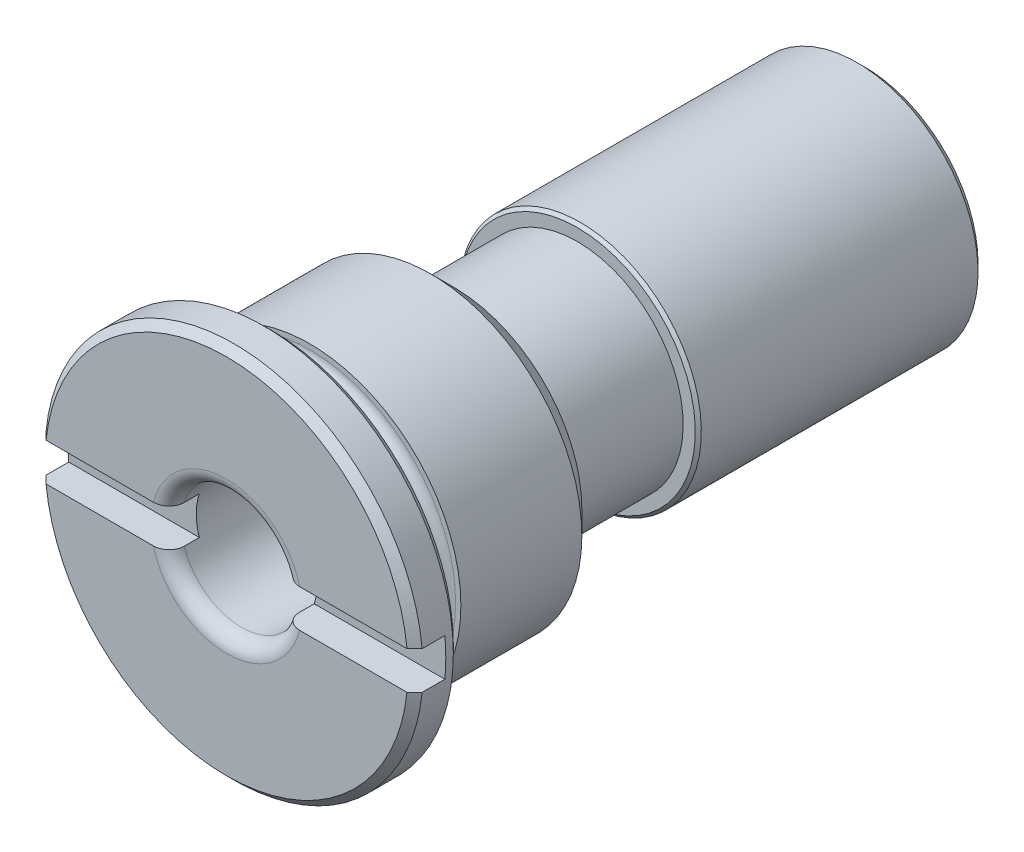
ISO-10303-21;
HEADER;
FILE_DESCRIPTION(('STEP AP214'),'2;1');
FILE_NAME('part.step','',(''),(''),'','','');
FILE_SCHEMA(('AUTOMOTIVE_DESIGN { 1 0 10303 214 1 1 1 1 }'));
ENDSEC;
DATA;
#1=APPLICATION_CONTEXT('core data for automotive mechanical design processes');
#2=APPLICATION_PROTOCOL_DEFINITION('international standard','automotive_design',2000,#1);
#3=PRODUCT_CONTEXT('',#1,'mechanical');
#4=PRODUCT('Part','Part','',(#3));
#5=PRODUCT_RELATED_PRODUCT_CATEGORY('part','',(#4));
#6=PRODUCT_DEFINITION_FORMATION('','',#4);
#7=PRODUCT_DEFINITION_CONTEXT('part definition',#1,'design');
#8=PRODUCT_DEFINITION('design','',#6,#7);
#9=PRODUCT_DEFINITION_SHAPE('','',#8);
#10=(LENGTH_UNIT() NAMED_UNIT(*) SI_UNIT(.MILLI.,.METRE.));
#11=(NAMED_UNIT(*) PLANE_ANGLE_UNIT() SI_UNIT($,.RADIAN.));
#12=(NAMED_UNIT(*) SI_UNIT($,.STERADIAN.) SOLID_ANGLE_UNIT());
#13=UNCERTAINTY_MEASURE_WITH_UNIT(LENGTH_MEASURE(1.E-05),#10,'distance_accuracy_value','');
#14=(GEOMETRIC_REPRESENTATION_CONTEXT(3) GLOBAL_UNCERTAINTY_ASSIGNED_CONTEXT((#13)) GLOBAL_UNIT_ASSIGNED_CONTEXT((#10,
#11,#12)) REPRESENTATION_CONTEXT('',''));
#15=CARTESIAN_POINT('',(0.,0.,0.));
#16=DIRECTION('',(0.,0.,1.));
#17=DIRECTION('',(1.,0.,0.));
#18=AXIS2_PLACEMENT_3D('',#15,#16,#17);
#19=CARTESIAN_POINT('',(0.,0.,-4.));
#20=DIRECTION('',(0.,0.,1.));
#21=DIRECTION('',(1.,0.,0.));
#22=AXIS2_PLACEMENT_3D('',#19,#20,#21);
#23=CYLINDRICAL_SURFACE('',#22,4.75);
#24=CARTESIAN_POINT('',(0.,0.,-12.4));
#25=DIRECTION('',(0.,0.,-1.));
#26=DIRECTION('',(-1.,0.,0.));
#27=AXIS2_PLACEMENT_3D('',#24,#25,#26);
#28=CIRCLE('',#27,4.75);
#29=CARTESIAN_POINT('',(-4.75,0.,-12.4));
#30=VERTEX_POINT('',#29);
#31=EDGE_CURVE('E272',#30,#30,#28,.T.);
#32=ORIENTED_EDGE('',*,*,#31,.T.);
#33=EDGE_LOOP('',(#32));
#34=FACE_BOUND('',#33,.T.);
#35=CARTESIAN_POINT('',(0.,0.,-12.6119891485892));
#36=DIRECTION('',(0.,0.,1.));
#37=DIRECTION('',(1.,0.,0.));
#38=AXIS2_PLACEMENT_3D('',#35,#36,#37);
#39=CIRCLE('',#38,4.75);
#40=CARTESIAN_POINT('',(4.75,0.,-12.6119891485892));
#41=VERTEX_POINT('',#40);
#42=EDGE_CURVE('E19',#41,#41,#39,.T.);
#43=ORIENTED_EDGE('',*,*,#42,.T.);
#44=EDGE_LOOP('',(#43));
#45=FACE_BOUND('',#44,.T.);
#46=ADVANCED_FACE('F14',(#34,#45),#23,.T.);
#47=CARTESIAN_POINT('',(0.,0.,-12.4));
#48=DIRECTION('',(0.,0.,-1.));
#49=DIRECTION('',(-1.,0.,0.));
#50=AXIS2_PLACEMENT_3D('',#47,#48,#49);
#51=TOROIDAL_SURFACE('',#50,5.15,0.4);
#52=CARTESIAN_POINT('',(0.,0.,-12.));
#53=DIRECTION('',(0.,0.,-1.));
#54=DIRECTION('',(-1.,0.,0.));
#55=AXIS2_PLACEMENT_3D('',#52,#53,#54);
#56=CIRCLE('',#55,5.15);
#57=CARTESIAN_POINT('',(-5.15,0.,-12.));
#58=VERTEX_POINT('',#57);
#59=EDGE_CURVE('E269',#58,#58,#56,.F.);
#60=ORIENTED_EDGE('',*,*,#59,.F.);
#61=EDGE_LOOP('',(#60));
#62=FACE_BOUND('',#61,.T.);
#63=ORIENTED_EDGE('',*,*,#31,.F.);
#64=EDGE_LOOP('',(#63));
#65=FACE_BOUND('',#64,.T.);
#66=ADVANCED_FACE('F302',(#62,#65),#51,.F.);
#67=CARTESIAN_POINT('',(0.,1.65,-42.));
#68=DIRECTION('',(0.,0.,1.));
#69=DIRECTION('',(1.,0.,0.));
#70=AXIS2_PLACEMENT_3D('',#67,#68,#69);
#71=PLANE('',#70);
#72=CARTESIAN_POINT('',(0.,0.,-42.));
#73=DIRECTION('',(0.,0.,1.));
#74=DIRECTION('',(1.,0.,0.));
#75=AXIS2_PLACEMENT_3D('',#72,#73,#74);
#76=CIRCLE('',#75,3.5);
#77=CARTESIAN_POINT('',(3.5,0.,-42.));
#78=VERTEX_POINT('',#77);
#79=EDGE_CURVE('E266',#78,#78,#76,.F.);
#80=ORIENTED_EDGE('',*,*,#79,.T.);
#81=EDGE_LOOP('',(#80));
#82=FACE_BOUND('',#81,.T.);
#83=ADVANCED_FACE('F304',(#82),#71,.F.);
#84=CARTESIAN_POINT('',(0.,0.,-41.5));
#85=DIRECTION('',(0.,0.,1.));
#86=DIRECTION('',(1.,0.,0.));
#87=AXIS2_PLACEMENT_3D('',#84,#85,#86);
#88=CONICAL_SURFACE('',#87,4.,0.785398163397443);
#89=ORIENTED_EDGE('',*,*,#79,.F.);
#90=EDGE_LOOP('',(#89));
#91=FACE_BOUND('',#90,.T.);
#92=CARTESIAN_POINT('',(0.,0.,-41.5));
#93=DIRECTION('',(0.,0.,1.));
#94=DIRECTION('',(1.,0.,0.));
#95=AXIS2_PLACEMENT_3D('',#92,#93,#94);
#96=CIRCLE('',#95,4.);
#97=CARTESIAN_POINT('',(4.,0.,-41.5));
#98=VERTEX_POINT('',#97);
#99=EDGE_CURVE('E263',#98,#98,#96,.T.);
#100=ORIENTED_EDGE('',*,*,#99,.F.);
#101=EDGE_LOOP('',(#100));
#102=FACE_BOUND('',#101,.T.);
#103=ADVANCED_FACE('F311',(#91,#102),#88,.T.);
#104=CARTESIAN_POINT('',(0.,0.,-4.));
#105=DIRECTION('',(0.,0.,1.));
#106=DIRECTION('',(1.,0.,0.));
#107=AXIS2_PLACEMENT_3D('',#104,#105,#106);
#108=CYLINDRICAL_SURFACE('',#107,4.);
#109=ORIENTED_EDGE('',*,*,#99,.T.);
#110=EDGE_LOOP('',(#109));
#111=FACE_BOUND('',#110,.T.);
#112=CARTESIAN_POINT('',(0.,0.,-39.2));
#113=DIRECTION('',(0.,0.,1.));
#114=DIRECTION('',(0.,-1.,0.));
#115=AXIS2_PLACEMENT_3D('',#112,#113,#114);
#116=CIRCLE('',#115,4.);
#117=CARTESIAN_POINT('',(0.,-4.,-39.2));
#118=VERTEX_POINT('',#117);
#119=EDGE_CURVE('E399',#118,#118,#116,.T.);
#120=ORIENTED_EDGE('',*,*,#119,.F.);
#121=EDGE_LOOP('',(#120));
#122=FACE_BOUND('',#121,.T.);
#123=ADVANCED_FACE('F321',(#111,#122),#108,.T.);
#124=CARTESIAN_POINT('',(4.,0.,-39.2));
#125=DIRECTION('',(0.,0.,1.));
#126=DIRECTION('',(0.,-1.,0.));
#127=AXIS2_PLACEMENT_3D('',#124,#125,#126);
#128=PLANE('',#127);
#129=CARTESIAN_POINT('',(0.,0.,-39.2));
#130=DIRECTION('',(0.,0.,1.));
#131=DIRECTION('',(0.,-1.,0.));
#132=AXIS2_PLACEMENT_3D('',#129,#130,#131);
#133=CIRCLE('',#132,7.5);
#134=CARTESIAN_POINT('',(0.,-7.5,-39.2));
#135=VERTEX_POINT('',#134);
#136=EDGE_CURVE('E405',#135,#135,#133,.F.);
#137=ORIENTED_EDGE('',*,*,#136,.T.);
#138=EDGE_LOOP('',(#137));
#139=FACE_BOUND('',#138,.T.);
#140=ORIENTED_EDGE('',*,*,#119,.T.);
#141=EDGE_LOOP('',(#140));
#142=FACE_BOUND('',#141,.T.);
#143=ADVANCED_FACE('F386',(#139,#142),#128,.F.);
#144=CARTESIAN_POINT('',(0.,0.,-38.7));
#145=DIRECTION('',(0.,0.,1.));
#146=DIRECTION('',(0.,-1.,0.));
#147=AXIS2_PLACEMENT_3D('',#144,#145,#146);
#148=CONICAL_SURFACE('',#147,8.,0.785398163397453);
#149=ORIENTED_EDGE('',*,*,#136,.F.);
#150=EDGE_LOOP('',(#149));
#151=FACE_BOUND('',#150,.T.);
#152=CARTESIAN_POINT('',(0.,0.,-38.7));
#153=DIRECTION('',(0.,0.,1.));
#154=DIRECTION('',(0.,-1.,0.));
#155=AXIS2_PLACEMENT_3D('',#152,#153,#154);
#156=CIRCLE('',#155,8.);
#157=CARTESIAN_POINT('',(0.,-8.,-38.7));
#158=VERTEX_POINT('',#157);
#159=EDGE_CURVE('E401',#158,#158,#156,.T.);
#160=ORIENTED_EDGE('',*,*,#159,.F.);
#161=EDGE_LOOP('',(#160));
#162=FACE_BOUND('',#161,.T.);
#163=ADVANCED_FACE('F392',(#151,#162),#148,.T.);
#164=CARTESIAN_POINT('',(0.,0.,-26.));
#165=DIRECTION('',(0.,0.,1.));
#166=DIRECTION('',(0.,-1.,0.));
#167=AXIS2_PLACEMENT_3D('',#164,#165,#166);
#168=CYLINDRICAL_SURFACE('',#167,8.);
#169=ORIENTED_EDGE('',*,*,#159,.T.);
#170=EDGE_LOOP('',(#169));
#171=FACE_BOUND('',#170,.T.);
#172=CARTESIAN_POINT('',(0.,0.,-20.4));
#173=DIRECTION('',(0.,0.,1.));
#174=DIRECTION('',(0.,-1.,0.));
#175=AXIS2_PLACEMENT_3D('',#172,#173,#174);
#176=CIRCLE('',#175,8.);
#177=CARTESIAN_POINT('',(0.,-8.,-20.4));
#178=VERTEX_POINT('',#177);
#179=EDGE_CURVE('E413',#178,#178,#176,.F.);
#180=ORIENTED_EDGE('',*,*,#179,.T.);
#181=EDGE_LOOP('',(#180));
#182=FACE_BOUND('',#181,.T.);
#183=ADVANCED_FACE('F298',(#171,#182),#168,.T.);
#184=CARTESIAN_POINT('',(0.,12.5,0.));
#185=DIRECTION('',(0.,0.,1.));
#186=DIRECTION('',(1.,0.,0.));
#187=AXIS2_PLACEMENT_3D('',#184,#185,#186);
#188=PLANE('',#187);
#189=CARTESIAN_POINT('',(0.,0.,0.));
#190=DIRECTION('',(0.,0.,1.));
#191=DIRECTION('',(1.,0.,0.));
#192=AXIS2_PLACEMENT_3D('',#189,#190,#191);
#193=CIRCLE('',#192,12.);
#194=CARTESIAN_POINT('',(12.,0.,0.));
#195=VERTEX_POINT('',#194);
#196=EDGE_CURVE('E141',#195,#195,#193,.F.);
#197=ORIENTED_EDGE('',*,*,#196,.T.);
#198=EDGE_LOOP('',(#197));
#199=FACE_BOUND('',#198,.T.);
#200=CARTESIAN_POINT('',(0.,0.,0.));
#201=DIRECTION('',(0.,0.,1.));
#202=DIRECTION('',(1.,0.,0.));
#203=AXIS2_PLACEMENT_3D('',#200,#201,#202);
#204=CIRCLE('',#203,9.65);
#205=CARTESIAN_POINT('',(9.65,0.,0.));
#206=VERTEX_POINT('',#205);
#207=EDGE_CURVE('E241',#206,#206,#204,.T.);
#208=ORIENTED_EDGE('',*,*,#207,.T.);
#209=EDGE_LOOP('',(#208));
#210=FACE_BOUND('',#209,.T.);
#211=ADVANCED_FACE('F285',(#199,#210),#188,.F.);
#212=CARTESIAN_POINT('',(0.,0.,0.5));
#213=DIRECTION('',(0.,0.,1.));
#214=DIRECTION('',(1.,0.,0.));
#215=AXIS2_PLACEMENT_3D('',#212,#213,#214);
#216=CONICAL_SURFACE('',#215,12.5,0.785398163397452);
#217=ORIENTED_EDGE('',*,*,#196,.F.);
#218=EDGE_LOOP('',(#217));
#219=FACE_BOUND('',#218,.T.);
#220=CARTESIAN_POINT('',(0.,0.,0.5));
#221=DIRECTION('',(0.,0.,1.));
#222=DIRECTION('',(1.,0.,0.));
#223=AXIS2_PLACEMENT_3D('',#220,#221,#222);
#224=CIRCLE('',#223,12.5);
#225=CARTESIAN_POINT('',(12.5,0.,0.5));
#226=VERTEX_POINT('',#225);
#227=EDGE_CURVE('E278',#226,#226,#224,.T.);
#228=ORIENTED_EDGE('',*,*,#227,.F.);
#229=EDGE_LOOP('',(#228));
#230=FACE_BOUND('',#229,.T.);
#231=ADVANCED_FACE('F288',(#219,#230),#216,.T.);
#232=CARTESIAN_POINT('',(0.,5.,3.));
#233=DIRECTION('',(0.,0.,-1.));
#234=DIRECTION('',(-1.,0.,0.));
#235=AXIS2_PLACEMENT_3D('',#232,#233,#234);
#236=PLANE('',#235);
#237=CARTESIAN_POINT('',(0.,0.,3.));
#238=DIRECTION('',(0.,0.,-1.));
#239=DIRECTION('',(-1.,0.,0.));
#240=AXIS2_PLACEMENT_3D('',#237,#238,#239);
#241=CIRCLE('',#240,12.);
#242=CARTESIAN_POINT('',(11.93471826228,1.25,3.));
#243=VERTEX_POINT('',#242);
#244=CARTESIAN_POINT('',(-11.93471826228,1.25,3.));
#245=VERTEX_POINT('',#244);
#246=EDGE_CURVE('E136',#243,#245,#241,.F.);
#247=ORIENTED_EDGE('',*,*,#246,.T.);
#248=DIRECTION('',(-1.,0.,0.));
#249=VECTOR('',#248,1.);
#250=CARTESIAN_POINT('',(-15.6357209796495,1.25,3.));
#251=LINE('',#250,#249);
#252=CARTESIAN_POINT('',(-4.84122918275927,1.25,3.));
#253=VERTEX_POINT('',#252);
#254=EDGE_CURVE('E31',#253,#245,#251,.T.);
#255=ORIENTED_EDGE('',*,*,#254,.F.);
#256=CARTESIAN_POINT('',(0.,0.,3.));
#257=DIRECTION('',(0.,0.,1.));
#258=DIRECTION('',(1.,0.,0.));
#259=AXIS2_PLACEMENT_3D('',#256,#257,#258);
#260=CIRCLE('',#259,5.);
#261=CARTESIAN_POINT('',(4.84122918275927,1.25,3.));
#262=VERTEX_POINT('',#261);
#263=EDGE_CURVE('E244',#262,#253,#260,.T.);
#264=ORIENTED_EDGE('',*,*,#263,.F.);
#265=EDGE_CURVE('E424',#243,#262,#251,.T.);
#266=ORIENTED_EDGE('',*,*,#265,.F.);
#267=EDGE_LOOP('',(#247,#255,#264,#266));
#268=FACE_BOUND('',#267,.T.);
#269=ADVANCED_FACE('F191',(#268),#236,.F.);
#270=CARTESIAN_POINT('',(0.,0.,3.));
#271=DIRECTION('',(0.,0.,-1.));
#272=DIRECTION('',(-1.,0.,0.));
#273=AXIS2_PLACEMENT_3D('',#270,#271,#272);
#274=CONICAL_SURFACE('',#273,12.,0.785398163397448);
#275=CARTESIAN_POINT('',(66.2638784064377,1.25,-51.2756673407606));
#276=CARTESIAN_POINT('',(64.0324207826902,1.25,-49.0446096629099));
#277=CARTESIAN_POINT('',(61.8009459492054,1.25,-46.8135691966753));
#278=CARTESIAN_POINT('',(57.3379400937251,1.25,-42.3515438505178));
#279=CARTESIAN_POINT('',(55.1064090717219,1.25,-40.1205589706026));
#280=CARTESIAN_POINT('',(50.6431948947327,1.25,-35.6585918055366));
#281=CARTESIAN_POINT('',(48.4115117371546,1.25,-33.4276095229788));
#282=CARTESIAN_POINT('',(43.9480299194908,1.25,-28.965761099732));
#283=CARTESIAN_POINT('',(41.7162312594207,1.25,-26.7348949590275));
#284=CARTESIAN_POINT('',(37.1396280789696,1.25,-22.160583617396));
#285=CARTESIAN_POINT('',(34.7948139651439,1.25,-19.8171480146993));
#286=CARTESIAN_POINT('',(30.1048307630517,1.25,-15.130630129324));
#287=CARTESIAN_POINT('',(27.7596616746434,1.25,-12.7875478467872));
#288=CARTESIAN_POINT('',(24.2413856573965,1.25,-9.27352585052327));
#289=CARTESIAN_POINT('',(23.0685595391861,1.25,-8.10230500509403));
#290=CARTESIAN_POINT('',(20.7226064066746,1.25,-5.76016431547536));
#291=CARTESIAN_POINT('',(19.5494793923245,1.25,-4.58924447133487));
#292=CARTESIAN_POINT('',(17.2027336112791,1.25,-2.24789929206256));
#293=CARTESIAN_POINT('',(16.0291148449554,1.25,-1.07747395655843));
#294=CARTESIAN_POINT('',(14.2679783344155,1.25,0.677452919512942));
#295=CARTESIAN_POINT('',(13.6808148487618,1.25,1.26230994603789));
#296=CARTESIAN_POINT('',(12.5061385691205,1.25,2.4316730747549));
#297=CARTESIAN_POINT('',(11.9186257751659,1.25,3.01617917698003));
#298=CARTESIAN_POINT('',(10.9076119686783,1.25,4.02109470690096));
#299=CARTESIAN_POINT('',(10.4842402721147,1.25,4.44163422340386));
#300=CARTESIAN_POINT('',(9.63707148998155,1.25,5.28234084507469));
#301=CARTESIAN_POINT('',(9.21327437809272,1.25,5.70250792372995));
#302=CARTESIAN_POINT('',(8.36839641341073,1.25,6.53896883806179));
#303=CARTESIAN_POINT('',(7.9473201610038,1.25,6.95526731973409));
#304=CARTESIAN_POINT('',(7.10434542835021,1.25,7.78686136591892));
#305=CARTESIAN_POINT('',(6.68244713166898,1.25,8.20215711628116));
#306=CARTESIAN_POINT('',(6.03463973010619,1.25,8.83741350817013));
#307=CARTESIAN_POINT('',(5.80929348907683,1.25,9.0579479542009));
#308=CARTESIAN_POINT('',(5.35783373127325,1.25,9.49850668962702));
#309=CARTESIAN_POINT('',(5.13171983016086,1.25,9.71853058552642));
#310=CARTESIAN_POINT('',(4.67512212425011,1.25,10.1609877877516));
#311=CARTESIAN_POINT('',(4.44462429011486,1.25,10.3834066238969));
#312=CARTESIAN_POINT('',(3.98267952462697,1.25,10.8262890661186));
#313=CARTESIAN_POINT('',(3.75123559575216,1.25,11.0467557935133));
#314=CARTESIAN_POINT('',(3.40067789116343,1.25,11.3770755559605));
#315=CARTESIAN_POINT('',(3.28244877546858,1.25,11.4878665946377));
#316=CARTESIAN_POINT('',(3.04516201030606,1.25,11.7085565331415));
#317=CARTESIAN_POINT('',(2.92610436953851,1.25,11.8184554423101));
#318=CARTESIAN_POINT('',(2.68587505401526,1.25,12.0379045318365));
#319=CARTESIAN_POINT('',(2.56469405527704,1.25,12.1474445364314));
#320=CARTESIAN_POINT('',(2.32076735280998,1.25,12.3645928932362));
#321=CARTESIAN_POINT('',(2.19802284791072,1.25,12.4722025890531));
#322=CARTESIAN_POINT('',(1.95361364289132,1.25,12.6815529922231));
#323=CARTESIAN_POINT('',(1.83201807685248,1.25,12.7833735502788));
#324=CARTESIAN_POINT('',(1.64672831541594,1.25,12.932900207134));
#325=CARTESIAN_POINT('',(1.58438740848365,1.25,12.9822794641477));
#326=CARTESIAN_POINT('',(1.45853841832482,1.25,13.079523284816));
#327=CARTESIAN_POINT('',(1.39503044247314,1.25,13.1273879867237));
#328=CARTESIAN_POINT('',(1.26745388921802,1.25,13.2203767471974));
#329=CARTESIAN_POINT('',(1.20340725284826,1.25,13.265530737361));
#330=CARTESIAN_POINT('',(1.07337962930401,1.25,13.3530851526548));
#331=CARTESIAN_POINT('',(1.00739747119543,1.25,13.3954838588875));
#332=CARTESIAN_POINT('',(0.873353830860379,1.25,13.4760619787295));
#333=CARTESIAN_POINT('',(0.805305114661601,1.25,13.5142624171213));
#334=CARTESIAN_POINT('',(0.666258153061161,1.25,13.5847897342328));
#335=CARTESIAN_POINT('',(0.59526498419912,1.25,13.6171262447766));
#336=CARTESIAN_POINT('',(0.50169736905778,1.25,13.6532149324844));
#337=CARTESIAN_POINT('',(0.480638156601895,1.25,13.6609264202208));
#338=CARTESIAN_POINT('',(0.438238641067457,1.25,13.6755543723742));
#339=CARTESIAN_POINT('',(0.416898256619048,1.25,13.6824706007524));
#340=CARTESIAN_POINT('',(0.352460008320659,1.25,13.701904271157));
#341=CARTESIAN_POINT('',(0.308951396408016,1.25,13.7131042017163));
#342=CARTESIAN_POINT('',(0.221442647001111,1.25,13.7312515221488));
#343=CARTESIAN_POINT('',(0.177450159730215,1.25,13.7382353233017));
#344=CARTESIAN_POINT('',(0.0889702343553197,1.25,13.7476087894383));
#345=CARTESIAN_POINT('',(0.044482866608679,1.25,13.7499990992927));
#346=CARTESIAN_POINT('',(-0.0379458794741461,1.25,13.7500007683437));
#347=CARTESIAN_POINT('',(-0.0758884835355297,1.25,13.7482627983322));
#348=CARTESIAN_POINT('',(-0.151456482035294,1.25,13.7414213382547));
#349=CARTESIAN_POINT('',(-0.189081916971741,1.25,13.7363182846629));
#350=CARTESIAN_POINT('',(-0.3015305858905,1.25,13.7162632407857));
#351=CARTESIAN_POINT('',(-0.375522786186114,1.25,13.696569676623));
#352=CARTESIAN_POINT('',(-0.52661378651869,1.25,13.6456484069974));
#353=CARTESIAN_POINT('',(-0.603402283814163,1.25,13.6135495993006));
#354=CARTESIAN_POINT('',(-0.753513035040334,1.25,13.5419435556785));
#355=CARTESIAN_POINT('',(-0.826828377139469,1.25,13.502422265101));
#356=CARTESIAN_POINT('',(-0.971017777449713,1.25,13.4182514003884));
#357=CARTESIAN_POINT('',(-1.04187367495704,1.25,13.3735712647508));
#358=CARTESIAN_POINT('',(-1.14644164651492,1.25,13.3040758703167));
#359=CARTESIAN_POINT('',(-1.1809975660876,1.25,13.2805085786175));
#360=CARTESIAN_POINT('',(-1.24962014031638,1.25,13.2326730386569));
#361=CARTESIAN_POINT('',(-1.28368680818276,1.25,13.208404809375));
#362=CARTESIAN_POINT('',(-1.39147831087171,1.25,13.1302106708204));
#363=CARTESIAN_POINT('',(-1.46440658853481,1.25,13.0751874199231));
#364=CARTESIAN_POINT('',(-1.60876258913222,1.25,12.9632006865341));
#365=CARTESIAN_POINT('',(-1.68019007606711,1.25,12.9062369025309));
#366=CARTESIAN_POINT('',(-1.82192987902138,1.25,12.7908752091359));
#367=CARTESIAN_POINT('',(-1.8922416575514,1.25,12.7324766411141));
#368=CARTESIAN_POINT('',(-2.03197563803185,1.25,12.6146230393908));
#369=CARTESIAN_POINT('',(-2.10139780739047,1.25,12.5551679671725));
#370=CARTESIAN_POINT('',(-2.30886338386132,1.25,12.3753974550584));
#371=CARTESIAN_POINT('',(-2.44586232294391,1.25,12.2538780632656));
#372=CARTESIAN_POINT('',(-2.71802884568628,1.25,12.0088950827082));
#373=CARTESIAN_POINT('',(-2.85319693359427,1.25,11.8854320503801));
#374=CARTESIAN_POINT('',(-3.12198176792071,1.25,11.637472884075));
#375=CARTESIAN_POINT('',(-3.25560145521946,1.25,11.5129799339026));
#376=CARTESIAN_POINT('',(-3.52197990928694,1.25,11.2630592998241));
#377=CARTESIAN_POINT('',(-3.65473861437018,1.25,11.1376315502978));
#378=CARTESIAN_POINT('',(-3.91947493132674,1.25,10.8862346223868));
#379=CARTESIAN_POINT('',(-4.05145322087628,1.25,10.7602661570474));
#380=CARTESIAN_POINT('',(-4.31492102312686,1.25,10.5078258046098));
#381=CARTESIAN_POINT('',(-4.44641054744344,1.25,10.381353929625));
#382=CARTESIAN_POINT('',(-4.83912465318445,1.25,10.0025166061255));
#383=CARTESIAN_POINT('',(-5.09979917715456,1.25,9.74958112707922));
#384=CARTESIAN_POINT('',(-5.62021585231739,1.25,9.24275235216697));
#385=CARTESIAN_POINT('',(-5.87995799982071,1.25,8.98885905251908));
#386=CARTESIAN_POINT('',(-6.65826468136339,1.25,8.2262216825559));
#387=CARTESIAN_POINT('',(-7.1758998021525,1.25,7.71652950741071));
#388=CARTESIAN_POINT('',(-8.21013139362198,1.25,6.69565614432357));
#389=CARTESIAN_POINT('',(-8.72672732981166,1.25,6.18447441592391));
#390=CARTESIAN_POINT('',(-9.7591612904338,1.25,5.16135505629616));
#391=CARTESIAN_POINT('',(-10.2749993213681,1.25,4.64941743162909));
#392=CARTESIAN_POINT('',(-11.3060651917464,1.25,3.62519775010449));
#393=CARTESIAN_POINT('',(-11.8212931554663,1.25,3.1129158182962));
#394=CARTESIAN_POINT('',(-12.8514287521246,1.25,2.08802762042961));
#395=CARTESIAN_POINT('',(-13.3663363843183,1.25,1.57542135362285));
#396=CARTESIAN_POINT('',(-14.3958512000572,1.25,0.550055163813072));
#397=CARTESIAN_POINT('',(-14.9104584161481,1.25,0.037295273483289));
#398=CARTESIAN_POINT('',(-15.9395062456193,1.25,-0.988390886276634));
#399=CARTESIAN_POINT('',(-16.4539468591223,1.25,-1.50131715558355));
#400=CARTESIAN_POINT('',(-17.9961463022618,1.25,-3.03934635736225));
#401=CARTESIAN_POINT('',(-19.0237207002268,1.25,-4.06463421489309));
#402=CARTESIAN_POINT('',(-21.0785716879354,1.25,-6.11550832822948));
#403=CARTESIAN_POINT('',(-22.105848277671,1.25,-7.14109458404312));
#404=CARTESIAN_POINT('',(-25.1873917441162,1.25,-10.2181414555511));
#405=CARTESIAN_POINT('',(-27.2413716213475,1.25,-12.2698894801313));
#406=CARTESIAN_POINT('',(-31.3490934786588,1.25,-16.373887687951));
#407=CARTESIAN_POINT('',(-33.4028354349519,1.25,-18.4261378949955));
#408=CARTESIAN_POINT('',(-37.510102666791,1.25,-22.5308546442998));
#409=CARTESIAN_POINT('',(-39.5636279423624,1.25,-24.5833211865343));
#410=CARTESIAN_POINT('',(-43.6712241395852,1.25,-28.6890668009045));
#411=CARTESIAN_POINT('',(-45.7252950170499,1.25,-30.7423459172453));
#412=CARTESIAN_POINT('',(-49.8333475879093,1.25,-34.848993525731));
#413=CARTESIAN_POINT('',(-51.8873292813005,1.25,-36.9023620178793));
#414=CARTESIAN_POINT('',(-55.9950977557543,1.25,-41.0090278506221));
#415=CARTESIAN_POINT('',(-58.0488845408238,1.25,-43.0623251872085));
#416=CARTESIAN_POINT('',(-62.1564120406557,1.25,-47.1689657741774));
#417=CARTESIAN_POINT('',(-64.21015275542,1.25,-49.2223090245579));
#418=CARTESIAN_POINT('',(-66.2638784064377,1.25,-51.2756673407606));
#419=B_SPLINE_CURVE_WITH_KNOTS('',3,(#275,#276,#277,#278,#279,#280,#281,#282,#283,#284,#285,
#286,#287,#288,#289,#290,#291,#292,#293,#294,#295,#296,#297,#298,#299,#300,#301,#302,#303,#304,
#305,#306,#307,#308,#309,#310,#311,#312,#313,#314,#315,#316,#317,#318,#319,#320,#321,#322,#323,
#324,#325,#326,#327,#328,#329,#330,#331,#332,#333,#334,#335,#336,#337,#338,#339,#340,#341,#342,
#343,#344,#345,#346,#347,#348,#349,#350,#351,#352,#353,#354,#355,#356,#357,#358,#359,#360,#361,
#362,#363,#364,#365,#366,#367,#368,#369,#370,#371,#372,#373,#374,#375,#376,#377,#378,#379,#380,
#381,#382,#383,#384,#385,#386,#387,#388,#389,#390,#391,#392,#393,#394,#395,#396,#397,#398,#399,
#400,#401,#402,#403,#404,#405,#406,#407,#408,#409,#410,#411,#412,#413,#414,#415,#416,#417,#418),
.UNSPECIFIED.,.F.,.F.,(4,2,2,2,2,2,2,2,2,2,2,2,2,2,2,2,2,2,2,2,2,2,2,2,2,2,2,2,2,2,2,2,2,2,2,2,
2,2,2,2,2,2,2,2,2,2,2,2,2,2,2,2,2,2,2,2,2,2,2,2,2,2,2,2,2,2,2,2,2,2,2,4),(0.,9.46642453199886,
18.932850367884,28.399593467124,37.8663352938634,47.8116152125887,57.7568991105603,
62.7293747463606,67.7018511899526,72.6743238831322,75.160559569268,77.6467950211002,
79.4370109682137,81.2273454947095,83.0037138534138,84.7797228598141,85.7256329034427,
86.6721202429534,87.6330512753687,88.5919679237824,89.0780459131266,89.5641188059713,
90.0541608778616,90.5438474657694,91.0195606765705,91.2581282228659,91.4966739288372,
91.731715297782,91.9669019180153,92.2008511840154,92.4344126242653,92.5016791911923,
92.568965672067,92.7035590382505,92.8369727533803,92.9703677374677,93.0841596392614,
93.1979367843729,93.4266848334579,93.6758073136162,93.9254063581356,94.1765682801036,
94.3020443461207,94.4275170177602,94.701534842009,94.9755954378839,95.2497842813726,
95.5239831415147,96.0733285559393,96.6225194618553,97.170394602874,97.7183085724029,
98.2656429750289,98.8129642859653,99.902614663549,100.992269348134,103.171619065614,
105.351894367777,107.532150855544,109.711837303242,111.891528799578,114.070907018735,
116.25028362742,120.605064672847,124.959845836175,133.669411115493,142.379536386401,
151.089660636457,159.802665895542,168.515671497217,177.228112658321,185.940553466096),.UNSPECIFIED.);
#420=CARTESIAN_POINT('',(12.4373429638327,1.25,2.5));
#421=VERTEX_POINT('',#420);
#422=EDGE_CURVE('E138',#421,#243,#419,.T.);
#423=ORIENTED_EDGE('',*,*,#422,.F.);
#424=CARTESIAN_POINT('',(0.,0.,2.5));
#425=DIRECTION('',(0.,0.,-1.));
#426=DIRECTION('',(-1.,0.,0.));
#427=AXIS2_PLACEMENT_3D('',#424,#425,#426);
#428=CIRCLE('',#427,12.5);
#429=CARTESIAN_POINT('',(-12.4373429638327,1.25,2.5));
#430=VERTEX_POINT('',#429);
#431=EDGE_CURVE('E276',#430,#421,#428,.T.);
#432=ORIENTED_EDGE('',*,*,#431,.F.);
#433=EDGE_CURVE('E135',#245,#430,#419,.T.);
#434=ORIENTED_EDGE('',*,*,#433,.F.);
#435=ORIENTED_EDGE('',*,*,#246,.F.);
#436=EDGE_LOOP('',(#423,#432,#434,#435));
#437=FACE_BOUND('',#436,.T.);
#438=ADVANCED_FACE('F156',(#437),#274,.T.);
#439=CARTESIAN_POINT('',(-11.93471826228,-1.25,3.));
#440=VERTEX_POINT('',#439);
#441=CARTESIAN_POINT('',(11.93471826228,-1.25,3.));
#442=VERTEX_POINT('',#441);
#443=EDGE_CURVE('E128',#440,#442,#241,.F.);
#444=ORIENTED_EDGE('',*,*,#443,.T.);
#445=DIRECTION('',(1.,0.,0.));
#446=VECTOR('',#445,1.);
#447=CARTESIAN_POINT('',(-15.6357209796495,-1.25,3.));
#448=LINE('',#447,#446);
#449=CARTESIAN_POINT('',(4.84122918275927,-1.25,3.));
#450=VERTEX_POINT('',#449);
#451=EDGE_CURVE('E131',#450,#442,#448,.T.);
#452=ORIENTED_EDGE('',*,*,#451,.F.);
#453=CARTESIAN_POINT('',(-4.84122918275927,-1.25,3.));
#454=VERTEX_POINT('',#453);
#455=EDGE_CURVE('E130',#454,#450,#260,.T.);
#456=ORIENTED_EDGE('',*,*,#455,.F.);
#457=EDGE_CURVE('E112',#440,#454,#448,.T.);
#458=ORIENTED_EDGE('',*,*,#457,.F.);
#459=EDGE_LOOP('',(#444,#452,#456,#458));
#460=FACE_BOUND('',#459,.T.);
#461=ADVANCED_FACE('F126',(#460),#236,.F.);
#462=CARTESIAN_POINT('',(-66.2638784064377,-1.25,-51.2756673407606));
#463=CARTESIAN_POINT('',(-64.0324207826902,-1.25,-49.0446096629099));
#464=CARTESIAN_POINT('',(-61.8009459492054,-1.25,-46.8135691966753));
#465=CARTESIAN_POINT('',(-57.3379400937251,-1.25,-42.3515438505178));
#466=CARTESIAN_POINT('',(-55.1064090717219,-1.25,-40.1205589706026));
#467=CARTESIAN_POINT('',(-50.6431948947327,-1.25,-35.6585918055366));
#468=CARTESIAN_POINT('',(-48.4115117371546,-1.25,-33.4276095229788));
#469=CARTESIAN_POINT('',(-43.9480299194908,-1.25,-28.965761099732));
#470=CARTESIAN_POINT('',(-41.7162312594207,-1.25,-26.7348949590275));
#471=CARTESIAN_POINT('',(-37.1396280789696,-1.25,-22.160583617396));
#472=CARTESIAN_POINT('',(-34.7948139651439,-1.25,-19.8171480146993));
#473=CARTESIAN_POINT('',(-30.1048307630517,-1.25,-15.130630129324));
#474=CARTESIAN_POINT('',(-27.7596616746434,-1.25,-12.7875478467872));
#475=CARTESIAN_POINT('',(-24.2413856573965,-1.25,-9.27352585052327));
#476=CARTESIAN_POINT('',(-23.0685595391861,-1.25,-8.10230500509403));
#477=CARTESIAN_POINT('',(-20.7226064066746,-1.25,-5.76016431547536));
#478=CARTESIAN_POINT('',(-19.5494793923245,-1.25,-4.58924447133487));
#479=CARTESIAN_POINT('',(-17.2027336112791,-1.25,-2.24789929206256));
#480=CARTESIAN_POINT('',(-16.0291148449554,-1.25,-1.07747395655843));
#481=CARTESIAN_POINT('',(-14.2679783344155,-1.25,0.677452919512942));
#482=CARTESIAN_POINT('',(-13.6808148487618,-1.25,1.26230994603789));
#483=CARTESIAN_POINT('',(-12.5061385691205,-1.25,2.4316730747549));
#484=CARTESIAN_POINT('',(-11.9186257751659,-1.25,3.01617917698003));
#485=CARTESIAN_POINT('',(-10.9076119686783,-1.25,4.02109470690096));
#486=CARTESIAN_POINT('',(-10.4842402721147,-1.25,4.44163422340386));
#487=CARTESIAN_POINT('',(-9.63707148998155,-1.25,5.28234084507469));
#488=CARTESIAN_POINT('',(-9.21327437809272,-1.25,5.70250792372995));
#489=CARTESIAN_POINT('',(-8.36839641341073,-1.25,6.53896883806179));
#490=CARTESIAN_POINT('',(-7.9473201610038,-1.25,6.95526731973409));
#491=CARTESIAN_POINT('',(-7.10434542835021,-1.25,7.78686136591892));
#492=CARTESIAN_POINT('',(-6.68244713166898,-1.25,8.20215711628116));
#493=CARTESIAN_POINT('',(-6.03463973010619,-1.25,8.83741350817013));
#494=CARTESIAN_POINT('',(-5.80929348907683,-1.25,9.0579479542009));
#495=CARTESIAN_POINT('',(-5.35783373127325,-1.25,9.49850668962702));
#496=CARTESIAN_POINT('',(-5.13171983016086,-1.25,9.71853058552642));
#497=CARTESIAN_POINT('',(-4.67512212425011,-1.25,10.1609877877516));
#498=CARTESIAN_POINT('',(-4.44462429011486,-1.25,10.3834066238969));
#499=CARTESIAN_POINT('',(-3.98267952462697,-1.25,10.8262890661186));
#500=CARTESIAN_POINT('',(-3.75123559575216,-1.25,11.0467557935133));
#501=CARTESIAN_POINT('',(-3.40067789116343,-1.25,11.3770755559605));
#502=CARTESIAN_POINT('',(-3.28244877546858,-1.25,11.4878665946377));
#503=CARTESIAN_POINT('',(-3.04516201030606,-1.25,11.7085565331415));
#504=CARTESIAN_POINT('',(-2.92610436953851,-1.25,11.8184554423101));
#505=CARTESIAN_POINT('',(-2.68587505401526,-1.25,12.0379045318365));
#506=CARTESIAN_POINT('',(-2.56469405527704,-1.25,12.1474445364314));
#507=CARTESIAN_POINT('',(-2.32076735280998,-1.25,12.3645928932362));
#508=CARTESIAN_POINT('',(-2.19802284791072,-1.25,12.4722025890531));
#509=CARTESIAN_POINT('',(-1.95361364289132,-1.25,12.6815529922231));
#510=CARTESIAN_POINT('',(-1.83201807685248,-1.25,12.7833735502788));
#511=CARTESIAN_POINT('',(-1.64672831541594,-1.25,12.932900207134));
#512=CARTESIAN_POINT('',(-1.58438740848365,-1.25,12.9822794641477));
#513=CARTESIAN_POINT('',(-1.45853841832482,-1.25,13.079523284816));
#514=CARTESIAN_POINT('',(-1.39503044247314,-1.25,13.1273879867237));
#515=CARTESIAN_POINT('',(-1.26745388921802,-1.25,13.2203767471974));
#516=CARTESIAN_POINT('',(-1.20340725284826,-1.25,13.265530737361));
#517=CARTESIAN_POINT('',(-1.07337962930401,-1.25,13.3530851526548));
#518=CARTESIAN_POINT('',(-1.00739747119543,-1.25,13.3954838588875));
#519=CARTESIAN_POINT('',(-0.873353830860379,-1.25,13.4760619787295));
#520=CARTESIAN_POINT('',(-0.805305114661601,-1.25,13.5142624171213));
#521=CARTESIAN_POINT('',(-0.666258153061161,-1.25,13.5847897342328));
#522=CARTESIAN_POINT('',(-0.59526498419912,-1.25,13.6171262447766));
#523=CARTESIAN_POINT('',(-0.50169736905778,-1.25,13.6532149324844));
#524=CARTESIAN_POINT('',(-0.480638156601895,-1.25,13.6609264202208));
#525=CARTESIAN_POINT('',(-0.438238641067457,-1.25,13.6755543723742));
#526=CARTESIAN_POINT('',(-0.416898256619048,-1.25,13.6824706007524));
#527=CARTESIAN_POINT('',(-0.352460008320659,-1.25,13.701904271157));
#528=CARTESIAN_POINT('',(-0.308951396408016,-1.25,13.7131042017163));
#529=CARTESIAN_POINT('',(-0.221442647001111,-1.25,13.7312515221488));
#530=CARTESIAN_POINT('',(-0.177450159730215,-1.25,13.7382353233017));
#531=CARTESIAN_POINT('',(-0.0889702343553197,-1.25,13.7476087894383));
#532=CARTESIAN_POINT('',(-0.044482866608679,-1.25,13.7499990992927));
#533=CARTESIAN_POINT('',(0.0379458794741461,-1.25,13.7500007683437));
#534=CARTESIAN_POINT('',(0.0758884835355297,-1.25,13.7482627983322));
#535=CARTESIAN_POINT('',(0.151456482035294,-1.25,13.7414213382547));
#536=CARTESIAN_POINT('',(0.189081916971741,-1.25,13.7363182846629));
#537=CARTESIAN_POINT('',(0.3015305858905,-1.25,13.7162632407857));
#538=CARTESIAN_POINT('',(0.375522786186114,-1.25,13.696569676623));
#539=CARTESIAN_POINT('',(0.52661378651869,-1.25,13.6456484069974));
#540=CARTESIAN_POINT('',(0.603402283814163,-1.25,13.6135495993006));
#541=CARTESIAN_POINT('',(0.753513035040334,-1.25,13.5419435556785));
#542=CARTESIAN_POINT('',(0.826828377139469,-1.25,13.502422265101));
#543=CARTESIAN_POINT('',(0.971017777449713,-1.25,13.4182514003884));
#544=CARTESIAN_POINT('',(1.04187367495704,-1.25,13.3735712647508));
#545=CARTESIAN_POINT('',(1.14644164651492,-1.25,13.3040758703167));
#546=CARTESIAN_POINT('',(1.1809975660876,-1.25,13.2805085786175));
#547=CARTESIAN_POINT('',(1.24962014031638,-1.25,13.2326730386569));
#548=CARTESIAN_POINT('',(1.28368680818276,-1.25,13.208404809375));
#549=CARTESIAN_POINT('',(1.39147831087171,-1.25,13.1302106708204));
#550=CARTESIAN_POINT('',(1.46440658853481,-1.25,13.0751874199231));
#551=CARTESIAN_POINT('',(1.60876258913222,-1.25,12.9632006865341));
#552=CARTESIAN_POINT('',(1.68019007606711,-1.25,12.9062369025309));
#553=CARTESIAN_POINT('',(1.82192987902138,-1.25,12.7908752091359));
#554=CARTESIAN_POINT('',(1.8922416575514,-1.25,12.7324766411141));
#555=CARTESIAN_POINT('',(2.03197563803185,-1.25,12.6146230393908));
#556=CARTESIAN_POINT('',(2.10139780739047,-1.25,12.5551679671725));
#557=CARTESIAN_POINT('',(2.30886338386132,-1.25,12.3753974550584));
#558=CARTESIAN_POINT('',(2.44586232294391,-1.25,12.2538780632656));
#559=CARTESIAN_POINT('',(2.71802884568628,-1.25,12.0088950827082));
#560=CARTESIAN_POINT('',(2.85319693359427,-1.25,11.8854320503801));
#561=CARTESIAN_POINT('',(3.12198176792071,-1.25,11.637472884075));
#562=CARTESIAN_POINT('',(3.25560145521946,-1.25,11.5129799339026));
#563=CARTESIAN_POINT('',(3.52197990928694,-1.25,11.2630592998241));
#564=CARTESIAN_POINT('',(3.65473861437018,-1.25,11.1376315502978));
#565=CARTESIAN_POINT('',(3.91947493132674,-1.25,10.8862346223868));
#566=CARTESIAN_POINT('',(4.05145322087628,-1.25,10.7602661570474));
#567=CARTESIAN_POINT('',(4.31492102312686,-1.25,10.5078258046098));
#568=CARTESIAN_POINT('',(4.44641054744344,-1.25,10.381353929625));
#569=CARTESIAN_POINT('',(4.83912465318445,-1.25,10.0025166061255));
#570=CARTESIAN_POINT('',(5.09979917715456,-1.25,9.74958112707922));
#571=CARTESIAN_POINT('',(5.62021585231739,-1.25,9.24275235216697));
#572=CARTESIAN_POINT('',(5.87995799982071,-1.25,8.98885905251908));
#573=CARTESIAN_POINT('',(6.65826468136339,-1.25,8.2262216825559));
#574=CARTESIAN_POINT('',(7.1758998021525,-1.25,7.71652950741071));
#575=CARTESIAN_POINT('',(8.21013139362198,-1.25,6.69565614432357));
#576=CARTESIAN_POINT('',(8.72672732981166,-1.25,6.18447441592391));
#577=CARTESIAN_POINT('',(9.7591612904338,-1.25,5.16135505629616));
#578=CARTESIAN_POINT('',(10.2749993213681,-1.25,4.64941743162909));
#579=CARTESIAN_POINT('',(11.3060651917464,-1.25,3.62519775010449));
#580=CARTESIAN_POINT('',(11.8212931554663,-1.25,3.1129158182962));
#581=CARTESIAN_POINT('',(12.8514287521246,-1.25,2.08802762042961));
#582=CARTESIAN_POINT('',(13.3663363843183,-1.25,1.57542135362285));
#583=CARTESIAN_POINT('',(14.3958512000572,-1.25,0.550055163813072));
#584=CARTESIAN_POINT('',(14.9104584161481,-1.25,0.037295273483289));
#585=CARTESIAN_POINT('',(15.9395062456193,-1.25,-0.988390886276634));
#586=CARTESIAN_POINT('',(16.4539468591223,-1.25,-1.50131715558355));
#587=CARTESIAN_POINT('',(17.9961463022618,-1.25,-3.03934635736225));
#588=CARTESIAN_POINT('',(19.0237207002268,-1.25,-4.06463421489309));
#589=CARTESIAN_POINT('',(21.0785716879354,-1.25,-6.11550832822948));
#590=CARTESIAN_POINT('',(22.105848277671,-1.25,-7.14109458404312));
#591=CARTESIAN_POINT('',(25.1873917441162,-1.25,-10.2181414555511));
#592=CARTESIAN_POINT('',(27.2413716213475,-1.25,-12.2698894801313));
#593=CARTESIAN_POINT('',(31.3490934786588,-1.25,-16.373887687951));
#594=CARTESIAN_POINT('',(33.4028354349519,-1.25,-18.4261378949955));
#595=CARTESIAN_POINT('',(37.510102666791,-1.25,-22.5308546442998));
#596=CARTESIAN_POINT('',(39.5636279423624,-1.25,-24.5833211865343));
#597=CARTESIAN_POINT('',(43.6712241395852,-1.25,-28.6890668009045));
#598=CARTESIAN_POINT('',(45.7252950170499,-1.25,-30.7423459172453));
#599=CARTESIAN_POINT('',(49.8333475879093,-1.25,-34.848993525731));
#600=CARTESIAN_POINT('',(51.8873292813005,-1.25,-36.9023620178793));
#601=CARTESIAN_POINT('',(55.9950977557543,-1.25,-41.0090278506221));
#602=CARTESIAN_POINT('',(58.0488845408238,-1.25,-43.0623251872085));
#603=CARTESIAN_POINT('',(62.1564120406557,-1.25,-47.1689657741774));
#604=CARTESIAN_POINT('',(64.21015275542,-1.25,-49.2223090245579));
#605=CARTESIAN_POINT('',(66.2638784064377,-1.25,-51.2756673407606));
#606=B_SPLINE_CURVE_WITH_KNOTS('',3,(#462,#463,#464,#465,#466,#467,#468,#469,#470,#471,#472,
#473,#474,#475,#476,#477,#478,#479,#480,#481,#482,#483,#484,#485,#486,#487,#488,#489,#490,#491,
#492,#493,#494,#495,#496,#497,#498,#499,#500,#501,#502,#503,#504,#505,#506,#507,#508,#509,#510,
#511,#512,#513,#514,#515,#516,#517,#518,#519,#520,#521,#522,#523,#524,#525,#526,#527,#528,#529,
#530,#531,#532,#533,#534,#535,#536,#537,#538,#539,#540,#541,#542,#543,#544,#545,#546,#547,#548,
#549,#550,#551,#552,#553,#554,#555,#556,#557,#558,#559,#560,#561,#562,#563,#564,#565,#566,#567,
#568,#569,#570,#571,#572,#573,#574,#575,#576,#577,#578,#579,#580,#581,#582,#583,#584,#585,#586,
#587,#588,#589,#590,#591,#592,#593,#594,#595,#596,#597,#598,#599,#600,#601,#602,#603,#604,#605),
.UNSPECIFIED.,.F.,.F.,(4,2,2,2,2,2,2,2,2,2,2,2,2,2,2,2,2,2,2,2,2,2,2,2,2,2,2,2,2,2,2,2,2,2,2,2,
2,2,2,2,2,2,2,2,2,2,2,2,2,2,2,2,2,2,2,2,2,2,2,2,2,2,2,2,2,2,2,2,2,2,2,4),(0.,9.46642453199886,
18.932850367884,28.399593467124,37.8663352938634,47.8116152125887,57.7568991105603,
62.7293747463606,67.7018511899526,72.6743238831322,75.160559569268,77.6467950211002,
79.4370109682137,81.2273454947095,83.0037138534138,84.7797228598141,85.7256329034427,
86.6721202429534,87.6330512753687,88.5919679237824,89.0780459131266,89.5641188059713,
90.0541608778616,90.5438474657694,91.0195606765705,91.2581282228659,91.4966739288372,
91.731715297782,91.9669019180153,92.2008511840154,92.4344126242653,92.5016791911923,
92.568965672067,92.7035590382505,92.8369727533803,92.9703677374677,93.0841596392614,
93.1979367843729,93.4266848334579,93.6758073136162,93.9254063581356,94.1765682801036,
94.3020443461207,94.4275170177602,94.701534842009,94.9755954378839,95.2497842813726,
95.5239831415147,96.0733285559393,96.6225194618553,97.170394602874,97.7183085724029,
98.2656429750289,98.8129642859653,99.902614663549,100.992269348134,103.171619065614,
105.351894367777,107.532150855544,109.711837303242,111.891528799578,114.070907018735,
116.25028362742,120.605064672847,124.959845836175,133.669411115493,142.379536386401,
151.089660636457,159.802665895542,168.515671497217,177.228112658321,185.940553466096),.UNSPECIFIED.);
#607=CARTESIAN_POINT('',(-12.4373429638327,-1.25,2.5));
#608=VERTEX_POINT('',#607);
#609=EDGE_CURVE('E108',#608,#440,#606,.T.);
#610=ORIENTED_EDGE('',*,*,#609,.F.);
#611=CARTESIAN_POINT('',(12.4373429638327,-1.25,2.5));
#612=VERTEX_POINT('',#611);
#613=EDGE_CURVE('E275',#612,#608,#428,.T.);
#614=ORIENTED_EDGE('',*,*,#613,.F.);
#615=EDGE_CURVE('E121',#442,#612,#606,.T.);
#616=ORIENTED_EDGE('',*,*,#615,.F.);
#617=ORIENTED_EDGE('',*,*,#443,.F.);
#618=EDGE_LOOP('',(#610,#614,#616,#617));
#619=FACE_BOUND('',#618,.T.);
#620=ADVANCED_FACE('F134',(#619),#274,.T.);
#621=CARTESIAN_POINT('',(0.,0.,11.3589921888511));
#622=DIRECTION('',(0.,0.,1.));
#623=DIRECTION('',(1.,0.,0.));
#624=AXIS2_PLACEMENT_3D('',#621,#622,#623);
#625=CYLINDRICAL_SURFACE('',#624,12.5);
#626=ORIENTED_EDGE('',*,*,#613,.T.);
#627=DIRECTION('',(0.,0.,1.));
#628=VECTOR('',#627,1.);
#629=CARTESIAN_POINT('',(-12.4373429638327,-1.25,11.3589921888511));
#630=LINE('',#629,#628);
#631=CARTESIAN_POINT('',(-12.4373429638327,-1.25,1.));
#632=VERTEX_POINT('',#631);
#633=EDGE_CURVE('E115',#608,#632,#630,.F.);
#634=ORIENTED_EDGE('',*,*,#633,.T.);
#635=CARTESIAN_POINT('',(0.,0.,1.));
#636=DIRECTION('',(0.,0.,1.));
#637=DIRECTION('',(1.,0.,0.));
#638=AXIS2_PLACEMENT_3D('',#635,#636,#637);
#639=CIRCLE('',#638,12.5);
#640=CARTESIAN_POINT('',(-12.4373429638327,1.25,1.));
#641=VERTEX_POINT('',#640);
#642=EDGE_CURVE('E402',#641,#632,#639,.T.);
#643=ORIENTED_EDGE('',*,*,#642,.F.);
#644=DIRECTION('',(0.,0.,1.));
#645=VECTOR('',#644,1.);
#646=CARTESIAN_POINT('',(-12.4373429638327,1.25,11.3589921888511));
#647=LINE('',#646,#645);
#648=EDGE_CURVE('E429',#641,#430,#647,.T.);
#649=ORIENTED_EDGE('',*,*,#648,.T.);
#650=ORIENTED_EDGE('',*,*,#431,.T.);
#651=DIRECTION('',(0.,0.,1.));
#652=VECTOR('',#651,1.);
#653=CARTESIAN_POINT('',(12.4373429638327,1.25,11.3589921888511));
#654=LINE('',#653,#652);
#655=CARTESIAN_POINT('',(12.4373429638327,1.25,1.));
#656=VERTEX_POINT('',#655);
#657=EDGE_CURVE('E39',#421,#656,#654,.F.);
#658=ORIENTED_EDGE('',*,*,#657,.T.);
#659=CARTESIAN_POINT('',(12.4373429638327,-1.25,1.));
#660=VERTEX_POINT('',#659);
#661=EDGE_CURVE('E120',#660,#656,#639,.T.);
#662=ORIENTED_EDGE('',*,*,#661,.F.);
#663=DIRECTION('',(0.,0.,1.));
#664=VECTOR('',#663,1.);
#665=CARTESIAN_POINT('',(12.4373429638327,-1.25,11.3589921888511));
#666=LINE('',#665,#664);
#667=EDGE_CURVE('E460',#660,#612,#666,.T.);
#668=ORIENTED_EDGE('',*,*,#667,.T.);
#669=EDGE_LOOP('',(#626,#634,#643,#649,#650,#658,#662,#668));
#670=FACE_BOUND('',#669,.T.);
#671=ORIENTED_EDGE('',*,*,#227,.T.);
#672=EDGE_LOOP('',(#671));
#673=FACE_BOUND('',#672,.T.);
#674=ADVANCED_FACE('F165',(#670,#673),#625,.T.);
#675=CARTESIAN_POINT('',(-15.6357209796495,1.25,1.));
#676=DIRECTION('',(0.,1.,0.));
#677=DIRECTION('',(-1.,0.,0.));
#678=AXIS2_PLACEMENT_3D('',#675,#676,#677);
#679=PLANE('',#678);
#680=CARTESIAN_POINT('',(-4.55376941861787,1.25,2.96064331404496));
#681=CARTESIAN_POINT('',(-4.49661420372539,1.25,2.94470333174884));
#682=CARTESIAN_POINT('',(-4.44074604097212,1.25,2.92399416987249));
#683=CARTESIAN_POINT('',(-4.33318671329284,1.25,2.87354219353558));
#684=CARTESIAN_POINT('',(-4.28150057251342,1.25,2.84378871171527));
#685=CARTESIAN_POINT('',(-4.18384568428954,1.25,2.77595213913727));
#686=CARTESIAN_POINT('',(-4.13788097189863,1.25,2.73786322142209));
#687=CARTESIAN_POINT('',(-4.05321064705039,1.25,2.65433655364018));
#688=CARTESIAN_POINT('',(-4.01450245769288,1.25,2.60890142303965));
#689=CARTESIAN_POINT('',(-3.94657016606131,1.25,2.5131166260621));
#690=CARTESIAN_POINT('',(-3.9171331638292,1.25,2.46291821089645));
#691=CARTESIAN_POINT('',(-3.86757955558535,1.25,2.35811127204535));
#692=CARTESIAN_POINT('',(-3.84746035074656,1.25,2.30350398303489));
#693=CARTESIAN_POINT('',(-3.81807426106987,1.25,2.19415668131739));
#694=CARTESIAN_POINT('',(-3.80834780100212,1.25,2.13954001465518));
#695=CARTESIAN_POINT('',(-3.79852333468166,1.25,2.0294516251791));
#696=CARTESIAN_POINT('',(-3.79842322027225,1.25,1.97398009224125));
#697=CARTESIAN_POINT('',(-3.80770635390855,1.25,1.86554394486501));
#698=CARTESIAN_POINT('',(-3.81680171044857,1.25,1.81255435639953));
#699=CARTESIAN_POINT('',(-3.84369135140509,1.25,1.70883581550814));
#700=CARTESIAN_POINT('',(-3.86148576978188,1.25,1.65810689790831));
#701=CARTESIAN_POINT('',(-3.90531133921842,1.25,1.55985136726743));
#702=CARTESIAN_POINT('',(-3.93140882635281,1.25,1.51235441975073));
#703=CARTESIAN_POINT('',(-3.99091975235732,1.25,1.42219460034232));
#704=CARTESIAN_POINT('',(-4.02433444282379,1.25,1.37953255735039));
#705=CARTESIAN_POINT('',(-4.09890420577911,1.25,1.29845741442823));
#706=CARTESIAN_POINT('',(-4.14031108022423,1.25,1.26027602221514));
#707=CARTESIAN_POINT('',(-4.22871445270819,1.25,1.19105387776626));
#708=CARTESIAN_POINT('',(-4.27571215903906,1.25,1.16001467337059));
#709=CARTESIAN_POINT('',(-4.37616661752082,1.25,1.10457901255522));
#710=CARTESIAN_POINT('',(-4.42981537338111,1.25,1.08053011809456));
#711=CARTESIAN_POINT('',(-4.54032546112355,1.25,1.04152896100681));
#712=CARTESIAN_POINT('',(-4.59718728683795,1.25,1.02657810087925));
#713=CARTESIAN_POINT('',(-4.71402440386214,1.25,1.00590752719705));
#714=CARTESIAN_POINT('',(-4.77404192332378,1.25,1.00042548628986));
#715=CARTESIAN_POINT('',(-4.89414891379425,1.25,0.999622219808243));
#716=CARTESIAN_POINT('',(-4.95423838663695,1.25,1.00430125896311));
#717=CARTESIAN_POINT('',(-5.07269714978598,1.25,1.0237675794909));
#718=CARTESIAN_POINT('',(-5.13106821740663,1.25,1.03854400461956));
#719=CARTESIAN_POINT('',(-5.24441746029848,1.25,1.07788448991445));
#720=CARTESIAN_POINT('',(-5.29939594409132,1.25,1.10244765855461));
#721=CARTESIAN_POINT('',(-5.40321398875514,1.25,1.16017464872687));
#722=CARTESIAN_POINT('',(-5.45215359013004,1.25,1.19315844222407));
#723=CARTESIAN_POINT('',(-5.54360479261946,1.25,1.26708215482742));
#724=CARTESIAN_POINT('',(-5.58611733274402,1.25,1.30802090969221));
#725=CARTESIAN_POINT('',(-5.66231068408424,1.25,1.39552622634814));
#726=CARTESIAN_POINT('',(-5.69619532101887,1.25,1.4419153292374));
#727=CARTESIAN_POINT('',(-5.75547868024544,1.25,1.53983228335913));
#728=CARTESIAN_POINT('',(-5.78087856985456,1.25,1.59135942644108));
#729=CARTESIAN_POINT('',(-5.82188085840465,1.25,1.69680883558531));
#730=CARTESIAN_POINT('',(-5.83769509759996,1.25,1.75064879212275));
#731=CARTESIAN_POINT('',(-5.85992122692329,1.25,1.86023485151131));
#732=CARTESIAN_POINT('',(-5.86633398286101,1.25,1.9159807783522));
#733=CARTESIAN_POINT('',(-5.86952924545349,1.25,2.02698949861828));
#734=CARTESIAN_POINT('',(-5.86644092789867,1.25,2.08224861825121));
#735=CARTESIAN_POINT('',(-5.85101346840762,1.25,2.19145803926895));
#736=CARTESIAN_POINT('',(-5.83867458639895,1.25,2.24540837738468));
#737=CARTESIAN_POINT('',(-5.80515993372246,1.25,2.35039476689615));
#738=CARTESIAN_POINT('',(-5.78399790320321,1.25,2.40143520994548));
#739=CARTESIAN_POINT('',(-5.73349031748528,1.25,2.4992890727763));
#740=CARTESIAN_POINT('',(-5.70414446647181,1.25,2.54610233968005));
#741=CARTESIAN_POINT('',(-5.63780381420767,1.25,2.63471854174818));
#742=CARTESIAN_POINT('',(-5.60073221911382,1.25,2.67646394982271));
#743=CARTESIAN_POINT('',(-5.52023339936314,1.25,2.75328731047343));
#744=CARTESIAN_POINT('',(-5.47680588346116,1.25,2.78836495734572));
#745=CARTESIAN_POINT('',(-5.38390296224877,1.25,2.85163366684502));
#746=CARTESIAN_POINT('',(-5.33432306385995,1.25,2.87967121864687));
#747=CARTESIAN_POINT('',(-5.23123526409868,1.25,2.92726873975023));
#748=CARTESIAN_POINT('',(-5.17772593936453,1.25,2.94682561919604));
#749=CARTESIAN_POINT('',(-5.0668256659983,1.25,2.97743529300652));
#750=CARTESIAN_POINT('',(-5.00936982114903,1.25,2.98825248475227));
#751=CARTESIAN_POINT('',(-4.89350760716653,1.25,3.00031194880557));
#752=CARTESIAN_POINT('',(-4.83510224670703,1.25,3.00156379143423));
#753=CARTESIAN_POINT('',(-4.73928052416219,1.25,2.99579522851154));
#754=CARTESIAN_POINT('',(-4.70167705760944,1.25,2.99151838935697));
#755=CARTESIAN_POINT('',(-4.62713133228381,1.25,2.97902099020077));
#756=CARTESIAN_POINT('',(-4.59018908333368,1.25,2.97080037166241));
#757=CARTESIAN_POINT('',(-4.55376941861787,1.25,2.96064331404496));
#758=B_SPLINE_CURVE_WITH_KNOTS('',3,(#680,#681,#682,#683,#684,#685,#686,#687,#688,#689,#690,
#691,#692,#693,#694,#695,#696,#697,#698,#699,#700,#701,#702,#703,#704,#705,#706,#707,#708,#709,
#710,#711,#712,#713,#714,#715,#716,#717,#718,#719,#720,#721,#722,#723,#724,#725,#726,#727,#728,
#729,#730,#731,#732,#733,#734,#735,#736,#737,#738,#739,#740,#741,#742,#743,#744,#745,#746,#747,
#748,#749,#750,#751,#752,#753,#754,#755,#756,#757),.UNSPECIFIED.,.T.,.F.,(4,2,2,2,2,2,2,2,2,2,2,
2,2,2,2,2,2,2,2,2,2,2,2,2,2,2,2,2,2,2,2,2,2,2,2,2,2,2,4),(0.,0.177874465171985,
0.355959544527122,0.53416951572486,0.712316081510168,0.886009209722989,1.05965386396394,
1.22525409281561,1.39081805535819,1.5513542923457,1.71189300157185,1.87374795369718,
2.03563061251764,2.20385039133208,2.37210659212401,2.54767956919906,2.72327960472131,
2.90322650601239,3.08317809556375,3.26293651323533,3.44267855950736,3.6188597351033,
3.79501514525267,3.96651209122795,4.13798543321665,4.30551618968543,4.47303151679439,
4.63827943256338,4.80352270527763,4.96850960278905,5.13350246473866,5.30022107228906,
5.46694732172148,5.63704322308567,5.8072010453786,5.98180576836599,6.1562357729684,
6.26957682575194,6.38291956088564),.UNSPECIFIED.);
#759=CARTESIAN_POINT('',(-3.79967103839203,1.25,2.00000000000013));
#760=VERTEX_POINT('',#759);
#761=EDGE_CURVE('E199',#253,#760,#758,.T.);
#762=ORIENTED_EDGE('',*,*,#761,.F.);
#763=ORIENTED_EDGE('',*,*,#254,.T.);
#764=ORIENTED_EDGE('',*,*,#433,.T.);
#765=ORIENTED_EDGE('',*,*,#648,.F.);
#766=DIRECTION('',(-1.,0.,0.));
#767=VECTOR('',#766,1.);
#768=CARTESIAN_POINT('',(-15.6357209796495,1.25,1.));
#769=LINE('',#768,#767);
#770=CARTESIAN_POINT('',(-3.79967103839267,1.25,1.));
#771=VERTEX_POINT('',#770);
#772=EDGE_CURVE('E425',#771,#641,#769,.T.);
#773=ORIENTED_EDGE('',*,*,#772,.F.);
#774=DIRECTION('',(0.,0.,1.));
#775=VECTOR('',#774,1.);
#776=CARTESIAN_POINT('',(-3.79967103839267,1.25,11.3589921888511));
#777=LINE('',#776,#775);
#778=EDGE_CURVE('E452',#760,#771,#777,.F.);
#779=ORIENTED_EDGE('',*,*,#778,.F.);
#780=EDGE_LOOP('',(#762,#763,#764,#765,#773,#779));
#781=FACE_BOUND('',#780,.T.);
#782=ADVANCED_FACE('F160',(#781),#679,.F.);
#783=CARTESIAN_POINT('',(0.,0.,2.));
#784=DIRECTION('',(0.,0.,1.));
#785=DIRECTION('',(1.,0.,0.));
#786=AXIS2_PLACEMENT_3D('',#783,#784,#785);
#787=TOROIDAL_SURFACE('',#786,5.,1.);
#788=ORIENTED_EDGE('',*,*,#263,.T.);
#789=ORIENTED_EDGE('',*,*,#761,.T.);
#790=CARTESIAN_POINT('',(0.,0.,2.));
#791=DIRECTION('',(0.,0.,1.));
#792=DIRECTION('',(1.,0.,0.));
#793=AXIS2_PLACEMENT_3D('',#790,#791,#792);
#794=CIRCLE('',#793,4.);
#795=CARTESIAN_POINT('',(3.79967103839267,1.25,2.));
#796=VERTEX_POINT('',#795);
#797=EDGE_CURVE('E248',#796,#760,#794,.T.);
#798=ORIENTED_EDGE('',*,*,#797,.F.);
#799=CARTESIAN_POINT('',(3.85999811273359,1.25,2.33378157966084));
#800=CARTESIAN_POINT('',(3.87968580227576,1.25,2.38666932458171));
#801=CARTESIAN_POINT('',(3.90401709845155,1.25,2.43788320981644));
#802=CARTESIAN_POINT('',(3.9610555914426,1.25,2.53547799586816));
#803=CARTESIAN_POINT('',(3.99377704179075,1.25,2.58185048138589));
#804=CARTESIAN_POINT('',(4.06637402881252,1.25,2.66841036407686));
#805=CARTESIAN_POINT('',(4.10623209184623,1.25,2.70861243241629));
#806=CARTESIAN_POINT('',(4.19191746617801,1.25,2.78200537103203));
#807=CARTESIAN_POINT('',(4.23774330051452,1.25,2.81519797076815));
#808=CARTESIAN_POINT('',(4.33570920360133,1.25,2.87483275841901));
#809=CARTESIAN_POINT('',(4.38800897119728,1.25,2.9010126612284));
#810=CARTESIAN_POINT('',(4.49618023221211,1.25,2.94450205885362));
#811=CARTESIAN_POINT('',(4.55205248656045,1.25,2.96180965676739));
#812=CARTESIAN_POINT('',(4.66747844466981,1.25,2.98747804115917));
#813=CARTESIAN_POINT('',(4.72709153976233,1.25,2.99557264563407));
#814=CARTESIAN_POINT('',(4.84683544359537,1.25,3.0016666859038));
#815=CARTESIAN_POINT('',(4.90696627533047,1.25,2.99966567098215));
#816=CARTESIAN_POINT('',(5.02616131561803,1.25,2.98552929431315));
#817=CARTESIAN_POINT('',(5.08522297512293,1.25,2.97337232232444));
#818=CARTESIAN_POINT('',(5.20039953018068,1.25,2.93913263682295));
#819=CARTESIAN_POINT('',(5.25651466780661,1.25,2.91705074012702));
#820=CARTESIAN_POINT('',(5.36310151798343,1.25,2.86397581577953));
#821=CARTESIAN_POINT('',(5.41365672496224,1.25,2.83315059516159));
#822=CARTESIAN_POINT('',(5.50868963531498,1.25,2.76323452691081));
#823=CARTESIAN_POINT('',(5.55316819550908,1.25,2.72414484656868));
#824=CARTESIAN_POINT('',(5.6335385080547,1.25,2.63991138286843));
#825=CARTESIAN_POINT('',(5.66962490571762,1.25,2.59495331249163));
#826=CARTESIAN_POINT('',(5.73351708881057,1.25,2.49949364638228));
#827=CARTESIAN_POINT('',(5.76132405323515,1.25,2.4489928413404));
#828=CARTESIAN_POINT('',(5.8071890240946,1.25,2.34518541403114));
#829=CARTESIAN_POINT('',(5.82546393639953,1.25,2.29197456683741));
#830=CARTESIAN_POINT('',(5.85266796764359,1.25,2.18321576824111));
#831=CARTESIAN_POINT('',(5.86159800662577,1.25,2.12766804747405));
#832=CARTESIAN_POINT('',(5.86976197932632,1.25,2.01670467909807));
#833=CARTESIAN_POINT('',(5.86913920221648,1.25,1.96129952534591));
#834=CARTESIAN_POINT('',(5.85856723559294,1.25,1.85138820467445));
#835=CARTESIAN_POINT('',(5.84861839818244,1.25,1.79688200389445));
#836=CARTESIAN_POINT('',(5.81975487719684,1.25,1.69048672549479));
#837=CARTESIAN_POINT('',(5.80086871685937,1.25,1.63858989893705));
#838=CARTESIAN_POINT('',(5.75472628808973,1.25,1.53866441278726));
#839=CARTESIAN_POINT('',(5.72746981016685,1.25,1.49063585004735));
#840=CARTESIAN_POINT('',(5.66513161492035,1.25,1.39932891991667));
#841=CARTESIAN_POINT('',(5.62998210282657,1.25,1.35609686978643));
#842=CARTESIAN_POINT('',(5.55304832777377,1.25,1.27601078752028));
#843=CARTESIAN_POINT('',(5.51126353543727,1.25,1.23915726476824));
#844=CARTESIAN_POINT('',(5.4214028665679,1.25,1.17209971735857));
#845=CARTESIAN_POINT('',(5.3732215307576,1.25,1.1420370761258));
#846=CARTESIAN_POINT('',(5.27259308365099,1.25,1.09019795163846));
#847=CARTESIAN_POINT('',(5.22014545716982,1.25,1.0684224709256));
#848=CARTESIAN_POINT('',(5.1110574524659,1.25,1.0331885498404));
#849=CARTESIAN_POINT('',(5.0543445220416,1.25,1.01995475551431));
#850=CARTESIAN_POINT('',(4.93951789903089,1.25,1.00294868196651));
#851=CARTESIAN_POINT('',(4.88140401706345,1.25,0.999177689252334));
#852=CARTESIAN_POINT('',(4.76392540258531,1.25,1.00114490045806));
#853=CARTESIAN_POINT('',(4.70456450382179,1.25,1.00711587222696));
#854=CARTESIAN_POINT('',(4.58764739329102,1.25,1.02880686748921));
#855=CARTESIAN_POINT('',(4.53009138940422,1.25,1.04452800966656));
#856=CARTESIAN_POINT('',(4.41768510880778,1.25,1.0855634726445));
#857=CARTESIAN_POINT('',(4.36287753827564,1.25,1.11099501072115));
#858=CARTESIAN_POINT('',(4.25836535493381,1.25,1.1707933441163));
#859=CARTESIAN_POINT('',(4.20866076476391,1.25,1.20516017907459));
#860=CARTESIAN_POINT('',(4.11642750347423,1.25,1.28154081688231));
#861=CARTESIAN_POINT('',(4.07382630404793,1.25,1.32346688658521));
#862=CARTESIAN_POINT('',(3.99659847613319,1.25,1.41411752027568));
#863=CARTESIAN_POINT('',(3.96196977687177,1.25,1.46284031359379));
#864=CARTESIAN_POINT('',(3.90311584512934,1.25,1.56377391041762));
#865=CARTESIAN_POINT('',(3.87854933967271,1.25,1.61578554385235));
#866=CARTESIAN_POINT('',(3.83897063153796,1.25,1.72334204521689));
#867=CARTESIAN_POINT('',(3.82395790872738,1.25,1.7788867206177));
#868=CARTESIAN_POINT('',(3.80457155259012,1.25,1.8892088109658));
#869=CARTESIAN_POINT('',(3.799748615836,1.25,1.94390784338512));
#870=CARTESIAN_POINT('',(3.79959555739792,1.25,2.05326638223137));
#871=CARTESIAN_POINT('',(3.80425136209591,1.25,2.10792582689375));
#872=CARTESIAN_POINT('',(3.81858404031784,1.25,2.19105820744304));
#873=CARTESIAN_POINT('',(3.82501192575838,1.25,2.22012877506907));
#874=CARTESIAN_POINT('',(3.84052908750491,1.25,2.27754848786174));
#875=CARTESIAN_POINT('',(3.8496182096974,1.25,2.30589767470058));
#876=CARTESIAN_POINT('',(3.85999811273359,1.25,2.33378157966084));
#877=B_SPLINE_CURVE_WITH_KNOTS('',3,(#799,#800,#801,#802,#803,#804,#805,#806,#807,#808,#809,
#810,#811,#812,#813,#814,#815,#816,#817,#818,#819,#820,#821,#822,#823,#824,#825,#826,#827,#828,
#829,#830,#831,#832,#833,#834,#835,#836,#837,#838,#839,#840,#841,#842,#843,#844,#845,#846,#847,
#848,#849,#850,#851,#852,#853,#854,#855,#856,#857,#858,#859,#860,#861,#862,#863,#864,#865,#866,
#867,#868,#869,#870,#871,#872,#873,#874,#875,#876),.UNSPECIFIED.,.T.,.F.,(4,2,2,2,2,2,2,2,2,2,2,
2,2,2,2,2,2,2,2,2,2,2,2,2,2,2,2,2,2,2,2,2,2,2,2,2,2,2,4),(0.,0.169185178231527,0.33865970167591,
0.507724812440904,0.676748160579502,0.851412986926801,1.02611514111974,1.20574597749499,
1.38538483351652,1.56540690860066,1.74541417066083,1.92217662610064,2.09891413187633,
2.27101538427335,2.4430921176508,2.61106052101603,2.77901238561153,2.94444752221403,
3.10987641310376,3.27478086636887,3.43968944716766,3.60607266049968,3.77246915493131,
3.94206309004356,4.111677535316,4.28558838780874,4.45952288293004,4.63767443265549,
4.81584642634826,4.99624090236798,5.17663617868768,5.35505874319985,5.53343491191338,
5.70512563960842,5.87680701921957,6.04074526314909,6.20444027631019,6.29364462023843,
6.38284379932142),.UNSPECIFIED.);
#878=EDGE_CURVE('E175',#796,#262,#877,.T.);
#879=ORIENTED_EDGE('',*,*,#878,.T.);
#880=EDGE_LOOP('',(#788,#789,#798,#879));
#881=FACE_BOUND('',#880,.T.);
#882=ADVANCED_FACE('F164',(#881),#787,.T.);
#883=CARTESIAN_POINT('',(3.79967103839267,1.25,1.));
#884=VERTEX_POINT('',#883);
#885=EDGE_CURVE('E427',#656,#884,#769,.T.);
#886=ORIENTED_EDGE('',*,*,#885,.F.);
#887=ORIENTED_EDGE('',*,*,#657,.F.);
#888=ORIENTED_EDGE('',*,*,#422,.T.);
#889=ORIENTED_EDGE('',*,*,#265,.T.);
#890=ORIENTED_EDGE('',*,*,#878,.F.);
#891=DIRECTION('',(0.,0.,1.));
#892=VECTOR('',#891,1.);
#893=CARTESIAN_POINT('',(3.79967103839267,1.25,11.3589921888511));
#894=LINE('',#893,#892);
#895=EDGE_CURVE('E183',#884,#796,#894,.T.);
#896=ORIENTED_EDGE('',*,*,#895,.F.);
#897=EDGE_LOOP('',(#886,#887,#888,#889,#890,#896));
#898=FACE_BOUND('',#897,.T.);
#899=ADVANCED_FACE('F166',(#898),#679,.F.);
#900=CARTESIAN_POINT('',(15.6357209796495,-1.25,1.));
#901=DIRECTION('',(0.,0.,1.));
#902=DIRECTION('',(1.,0.,0.));
#903=AXIS2_PLACEMENT_3D('',#900,#901,#902);
#904=PLANE('',#903);
#905=CARTESIAN_POINT('',(0.,0.,1.));
#906=DIRECTION('',(0.,0.,1.));
#907=DIRECTION('',(1.,0.,0.));
#908=AXIS2_PLACEMENT_3D('',#905,#906,#907);
#909=CIRCLE('',#908,4.);
#910=CARTESIAN_POINT('',(3.79967103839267,-1.25,1.));
#911=VERTEX_POINT('',#910);
#912=EDGE_CURVE('E223',#884,#911,#909,.F.);
#913=ORIENTED_EDGE('',*,*,#912,.T.);
#914=DIRECTION('',(1.,0.,0.));
#915=VECTOR('',#914,1.);
#916=CARTESIAN_POINT('',(-15.6357209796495,-1.25,1.));
#917=LINE('',#916,#915);
#918=EDGE_CURVE('E420',#911,#660,#917,.T.);
#919=ORIENTED_EDGE('',*,*,#918,.T.);
#920=ORIENTED_EDGE('',*,*,#661,.T.);
#921=ORIENTED_EDGE('',*,*,#885,.T.);
#922=EDGE_LOOP('',(#913,#919,#920,#921));
#923=FACE_BOUND('',#922,.T.);
#924=ADVANCED_FACE('F437',(#923),#904,.T.);
#925=CARTESIAN_POINT('',(-15.6357209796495,-1.25,1.));
#926=DIRECTION('',(0.,-1.,0.));
#927=DIRECTION('',(1.,0.,0.));
#928=AXIS2_PLACEMENT_3D('',#925,#926,#927);
#929=PLANE('',#928);
#930=CARTESIAN_POINT('',(3.85999811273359,-1.25,2.33378157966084));
#931=CARTESIAN_POINT('',(3.84127810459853,-1.25,2.28347834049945));
#932=CARTESIAN_POINT('',(3.82673001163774,-1.25,2.23158873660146));
#933=CARTESIAN_POINT('',(3.80654441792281,-1.25,2.12607082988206));
#934=CARTESIAN_POINT('',(3.80091381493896,-1.25,2.07244121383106));
#935=CARTESIAN_POINT('',(3.79879722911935,-1.25,1.96499987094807));
#936=CARTESIAN_POINT('',(3.80231086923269,-1.25,1.91118815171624));
#937=CARTESIAN_POINT('',(3.81834465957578,-1.25,1.8049366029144));
#938=CARTESIAN_POINT('',(3.83086364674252,-1.25,1.75249659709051));
#939=CARTESIAN_POINT('',(3.86440966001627,-1.25,1.65049833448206));
#940=CARTESIAN_POINT('',(3.88542544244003,-1.25,1.60093636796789));
#941=CARTESIAN_POINT('',(3.93522876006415,-1.25,1.50588956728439));
#942=CARTESIAN_POINT('',(3.96401746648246,-1.25,1.4604053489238));
#943=CARTESIAN_POINT('',(4.02948348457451,-1.25,1.37321917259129));
#944=CARTESIAN_POINT('',(4.06638366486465,-1.25,1.33168472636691));
#945=CARTESIAN_POINT('',(4.14636068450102,-1.25,1.25506674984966));
#946=CARTESIAN_POINT('',(4.18943884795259,-1.25,1.21998460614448));
#947=CARTESIAN_POINT('',(4.28263960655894,-1.25,1.15561555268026));
#948=CARTESIAN_POINT('',(4.33299244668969,-1.25,1.12666182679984));
#949=CARTESIAN_POINT('',(4.43773088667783,-1.25,1.07731072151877));
#950=CARTESIAN_POINT('',(4.49211721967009,-1.25,1.05691490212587));
#951=CARTESIAN_POINT('',(4.6052638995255,-1.25,1.02465711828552));
#952=CARTESIAN_POINT('',(4.66410863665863,-1.25,1.01309038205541));
#953=CARTESIAN_POINT('',(4.78290645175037,-1.25,0.999923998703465));
#954=CARTESIAN_POINT('',(4.84285960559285,-1.25,0.998325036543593));
#955=CARTESIAN_POINT('',(4.96258876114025,-1.25,1.00522614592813));
#956=CARTESIAN_POINT('',(5.02236093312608,-1.25,1.01379345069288));
#957=CARTESIAN_POINT('',(5.13957213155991,-1.25,1.04099843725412));
#958=CARTESIAN_POINT('',(5.19701129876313,-1.25,1.05963551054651));
#959=CARTESIAN_POINT('',(5.30696477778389,-1.25,1.10619474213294));
#960=CARTESIAN_POINT('',(5.35954088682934,-1.25,1.13397080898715));
#961=CARTESIAN_POINT('',(5.45911605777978,-1.25,1.19817770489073));
#962=CARTESIAN_POINT('',(5.50611588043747,-1.25,1.23460735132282));
#963=CARTESIAN_POINT('',(5.59191092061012,-1.25,1.31408814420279));
#964=CARTESIAN_POINT('',(5.63088564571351,-1.25,1.35694550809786));
#965=CARTESIAN_POINT('',(5.70086423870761,-1.25,1.44873853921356));
#966=CARTESIAN_POINT('',(5.73186926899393,-1.25,1.49767331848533));
#967=CARTESIAN_POINT('',(5.78422941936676,-1.25,1.59891425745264));
#968=CARTESIAN_POINT('',(5.80580552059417,-1.25,1.65110618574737));
#969=CARTESIAN_POINT('',(5.83971844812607,-1.25,1.75840977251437));
#970=CARTESIAN_POINT('',(5.85205627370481,-1.25,1.81352111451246));
#971=CARTESIAN_POINT('',(5.86696479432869,-1.25,1.92409983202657));
#972=CARTESIAN_POINT('',(5.86969672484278,-1.25,1.97954552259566));
#973=CARTESIAN_POINT('',(5.86575765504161,-1.25,2.09010017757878));
#974=CARTESIAN_POINT('',(5.85908711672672,-1.25,2.14520915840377));
#975=CARTESIAN_POINT('',(5.83661644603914,-1.25,2.2532217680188));
#976=CARTESIAN_POINT('',(5.82086540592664,-1.25,2.30613562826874));
#977=CARTESIAN_POINT('',(5.7807619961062,-1.25,2.40859380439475));
#978=CARTESIAN_POINT('',(5.7564095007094,-1.25,2.45813807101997));
#979=CARTESIAN_POINT('',(5.69965015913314,-1.25,2.55283581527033));
#980=CARTESIAN_POINT('',(5.66718916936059,-1.25,2.59795681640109));
#981=CARTESIAN_POINT('',(5.59527384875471,-1.25,2.68222648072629));
#982=CARTESIAN_POINT('',(5.55581902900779,-1.25,2.72137472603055));
#983=CARTESIAN_POINT('',(5.47031142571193,-1.25,2.79334456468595));
#984=CARTESIAN_POINT('',(5.42415463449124,-1.25,2.82604252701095));
#985=CARTESIAN_POINT('',(5.32711409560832,-1.25,2.88344171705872));
#986=CARTESIAN_POINT('',(5.27622979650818,-1.25,2.90814201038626));
#987=CARTESIAN_POINT('',(5.16984259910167,-1.25,2.94949839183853));
#988=CARTESIAN_POINT('',(5.11425672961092,-1.25,2.96594100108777));
#989=CARTESIAN_POINT('',(5.00114517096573,-1.25,2.98951374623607));
#990=CARTESIAN_POINT('',(4.94361921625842,-1.25,2.99664260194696));
#991=CARTESIAN_POINT('',(4.8267190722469,-1.25,3.00154599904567));
#992=CARTESIAN_POINT('',(4.76733477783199,-1.25,2.99908084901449));
#993=CARTESIAN_POINT('',(4.64978751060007,-1.25,2.98437899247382));
#994=CARTESIAN_POINT('',(4.59162464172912,-1.25,2.97214145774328));
#995=CARTESIAN_POINT('',(4.47724106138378,-1.25,2.93796860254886));
#996=CARTESIAN_POINT('',(4.42106390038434,-1.25,2.91588721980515));
#997=CARTESIAN_POINT('',(4.31322207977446,-1.25,2.86254693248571));
#998=CARTESIAN_POINT('',(4.26155869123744,-1.25,2.83128545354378));
#999=CARTESIAN_POINT('',(4.16461922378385,-1.25,2.7605762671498));
#1000=CARTESIAN_POINT('',(4.11930875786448,-1.25,2.72117573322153));
#1001=CARTESIAN_POINT('',(4.03626970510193,-1.25,2.63512112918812));
#1002=CARTESIAN_POINT('',(3.99853041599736,-1.25,2.58847746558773));
#1003=CARTESIAN_POINT('',(3.94380136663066,-1.25,2.50689202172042));
#1004=CARTESIAN_POINT('',(3.92420117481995,-1.25,2.47367277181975));
#1005=CARTESIAN_POINT('',(3.88901720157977,-1.25,2.40516850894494));
#1006=CARTESIAN_POINT('',(3.87343323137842,-1.25,2.36988359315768));
#1007=CARTESIAN_POINT('',(3.85999811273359,-1.25,2.33378157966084));
#1008=B_SPLINE_CURVE_WITH_KNOTS('',3,(#930,#931,#932,#933,#934,#935,#936,#937,#938,#939,#940,
#941,#942,#943,#944,#945,#946,#947,#948,#949,#950,#951,#952,#953,#954,#955,#956,#957,#958,#959,
#960,#961,#962,#963,#964,#965,#966,#967,#968,#969,#970,#971,#972,#973,#974,#975,#976,#977,#978,
#979,#980,#981,#982,#983,#984,#985,#986,#987,#988,#989,#990,#991,#992,#993,#994,#995,#996,#997,
#998,#999,#1000,#1001,#1002,#1003,#1004,#1005,#1006,#1007),.UNSPECIFIED.,.T.,.F.,(4,2,2,2,2,2,2,
2,2,2,2,2,2,2,2,2,2,2,2,2,2,2,2,2,2,2,2,2,2,2,2,2,2,2,2,2,2,2,4),(0.,0.160883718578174,
0.321891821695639,0.482893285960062,0.64387396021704,0.804642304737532,0.96543488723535,
1.13137051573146,1.297341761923,1.47080685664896,1.64430355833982,1.82337435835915,
2.00245746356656,2.18273154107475,2.36299472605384,2.54050597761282,2.71799298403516,
2.89092800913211,3.06383779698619,3.23244379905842,3.40103156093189,3.5667756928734,
3.73251168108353,3.89735993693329,4.06221060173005,4.22819292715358,4.39418686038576,
4.56310563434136,4.73204413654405,4.90515026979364,5.07828019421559,5.25576293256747,
5.43326071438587,5.61348470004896,5.7937592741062,5.97301691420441,6.15201935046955,
6.26748903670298,6.38295329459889),.UNSPECIFIED.);
#1009=CARTESIAN_POINT('',(3.79967103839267,-1.25,2.));
#1010=VERTEX_POINT('',#1009);
#1011=EDGE_CURVE('E205',#450,#1010,#1008,.T.);
#1012=ORIENTED_EDGE('',*,*,#1011,.F.);
#1013=ORIENTED_EDGE('',*,*,#451,.T.);
#1014=ORIENTED_EDGE('',*,*,#615,.T.);
#1015=ORIENTED_EDGE('',*,*,#667,.F.);
#1016=ORIENTED_EDGE('',*,*,#918,.F.);
#1017=DIRECTION('',(0.,0.,1.));
#1018=VECTOR('',#1017,1.);
#1019=CARTESIAN_POINT('',(3.79967103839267,-1.25,11.3589921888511));
#1020=LINE('',#1019,#1018);
#1021=EDGE_CURVE('E212',#1010,#911,#1020,.F.);
#1022=ORIENTED_EDGE('',*,*,#1021,.F.);
#1023=EDGE_LOOP('',(#1012,#1013,#1014,#1015,#1016,#1022));
#1024=FACE_BOUND('',#1023,.T.);
#1025=ADVANCED_FACE('F448',(#1024),#929,.F.);
#1026=CARTESIAN_POINT('',(-3.79967103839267,-1.25,2.));
#1027=VERTEX_POINT('',#1026);
#1028=EDGE_CURVE('E247',#1027,#1010,#794,.T.);
#1029=ORIENTED_EDGE('',*,*,#1028,.F.);
#1030=CARTESIAN_POINT('',(-4.55376941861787,-1.25,2.96064331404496));
#1031=CARTESIAN_POINT('',(-4.61144604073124,-1.25,2.97672398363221));
#1032=CARTESIAN_POINT('',(-4.67051775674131,-1.25,2.98797138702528));
#1033=CARTESIAN_POINT('',(-4.78976523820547,-1.25,3.00044281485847));
#1034=CARTESIAN_POINT('',(-4.84994232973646,-1.25,3.00165388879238));
#1035=CARTESIAN_POINT('',(-4.96965591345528,-1.25,2.99392941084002));
#1036=CARTESIAN_POINT('',(-5.02919237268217,-1.25,2.98499333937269));
#1037=CARTESIAN_POINT('',(-5.14586369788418,-1.25,2.95712467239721));
#1038=CARTESIAN_POINT('',(-5.20299935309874,-1.25,2.93819539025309));
#1039=CARTESIAN_POINT('',(-5.3124705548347,-1.25,2.89107247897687));
#1040=CARTESIAN_POINT('',(-5.36485724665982,-1.25,2.86299781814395));
#1041=CARTESIAN_POINT('',(-5.46400718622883,-1.25,2.79822901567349));
#1042=CARTESIAN_POINT('',(-5.51077090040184,-1.25,2.76153558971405));
#1043=CARTESIAN_POINT('',(-5.59605493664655,-1.25,2.68158100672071));
#1044=CARTESIAN_POINT('',(-5.63475627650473,-1.25,2.63851294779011));
#1045=CARTESIAN_POINT('',(-5.70415643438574,-1.25,2.54634954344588));
#1046=CARTESIAN_POINT('',(-5.73485645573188,-1.25,2.49725510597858));
#1047=CARTESIAN_POINT('',(-5.78659543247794,-1.25,2.39574964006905));
#1048=CARTESIAN_POINT('',(-5.80785508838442,-1.25,2.34345104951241));
#1049=CARTESIAN_POINT('',(-5.84112330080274,-1.25,2.23599028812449));
#1050=CARTESIAN_POINT('',(-5.85313286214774,-1.25,2.18082842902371));
#1051=CARTESIAN_POINT('',(-5.8673907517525,-1.25,2.07019637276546));
#1052=CARTESIAN_POINT('',(-5.86979865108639,-1.25,2.01474668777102));
#1053=CARTESIAN_POINT('',(-5.86521758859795,-1.25,1.90423851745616));
#1054=CARTESIAN_POINT('',(-5.85822906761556,-1.25,1.849180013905));
#1055=CARTESIAN_POINT('',(-5.83513764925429,-1.25,1.74130856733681));
#1056=CARTESIAN_POINT('',(-5.81908184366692,-1.25,1.6884855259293));
#1057=CARTESIAN_POINT('',(-5.77839010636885,-1.25,1.58625770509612));
#1058=CARTESIAN_POINT('',(-5.75375404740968,-1.25,1.53685297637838));
#1059=CARTESIAN_POINT('',(-5.69644916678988,-1.25,1.44246927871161));
#1060=CARTESIAN_POINT('',(-5.66372480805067,-1.25,1.39752405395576));
#1061=CARTESIAN_POINT('',(-5.59131638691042,-1.25,1.31364579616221));
#1062=CARTESIAN_POINT('',(-5.55163182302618,-1.25,1.27471319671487));
#1063=CARTESIAN_POINT('',(-5.46569356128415,-1.25,1.20320604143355));
#1064=CARTESIAN_POINT('',(-5.41933561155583,-1.25,1.1707568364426));
#1065=CARTESIAN_POINT('',(-5.32193659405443,-1.25,1.11388411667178));
#1066=CARTESIAN_POINT('',(-5.27089498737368,-1.25,1.08946152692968));
#1067=CARTESIAN_POINT('',(-5.16423304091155,-1.25,1.04868735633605));
#1068=CARTESIAN_POINT('',(-5.10853065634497,-1.25,1.03255043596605));
#1069=CARTESIAN_POINT('',(-4.99523755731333,-1.25,1.00960462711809));
#1070=CARTESIAN_POINT('',(-4.93764658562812,-1.25,1.00279701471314));
#1071=CARTESIAN_POINT('',(-4.82067346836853,-1.25,0.998552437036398));
#1072=CARTESIAN_POINT('',(-4.76128259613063,-1.25,1.0013545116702));
#1073=CARTESIAN_POINT('',(-4.64377627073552,-1.25,1.01672934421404));
#1074=CARTESIAN_POINT('',(-4.58566097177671,-1.25,1.02930327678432));
#1075=CARTESIAN_POINT('',(-4.47143944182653,-1.25,1.0641438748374));
#1076=CARTESIAN_POINT('',(-4.41537715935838,-1.25,1.08655492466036));
#1077=CARTESIAN_POINT('',(-4.30783645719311,-1.25,1.14052767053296));
#1078=CARTESIAN_POINT('',(-4.25635817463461,-1.25,1.1720896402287));
#1079=CARTESIAN_POINT('',(-4.15988415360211,-1.25,1.24333834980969));
#1080=CARTESIAN_POINT('',(-4.11484791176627,-1.25,1.2829701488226));
#1081=CARTESIAN_POINT('',(-4.03235012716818,-1.25,1.36946765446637));
#1082=CARTESIAN_POINT('',(-3.9948872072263,-1.25,1.41633204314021));
#1083=CARTESIAN_POINT('',(-3.93002382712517,-1.25,1.51431276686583));
#1084=CARTESIAN_POINT('',(-3.90232667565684,-1.25,1.56523245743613));
#1085=CARTESIAN_POINT('',(-3.85635601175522,-1.25,1.67116149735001));
#1086=CARTESIAN_POINT('',(-3.8380793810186,-1.25,1.72616948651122));
#1087=CARTESIAN_POINT('',(-3.81232299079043,-1.25,1.83596234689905));
#1088=CARTESIAN_POINT('',(-3.80438159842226,-1.25,1.89063913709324));
#1089=CARTESIAN_POINT('',(-3.79807940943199,-1.25,2.00053820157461));
#1090=CARTESIAN_POINT('',(-3.7997167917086,-1.25,2.05576037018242));
#1091=CARTESIAN_POINT('',(-3.81232425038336,-1.25,2.16358518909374));
#1092=CARTESIAN_POINT('',(-3.82303756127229,-1.25,2.21621816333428));
#1093=CARTESIAN_POINT('',(-3.85304868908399,-1.25,2.31896909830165));
#1094=CARTESIAN_POINT('',(-3.87234644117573,-1.25,2.36908707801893));
#1095=CARTESIAN_POINT('',(-3.91911384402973,-1.25,2.4660667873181));
#1096=CARTESIAN_POINT('',(-3.94667628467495,-1.25,2.51288366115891));
#1097=CARTESIAN_POINT('',(-4.0089850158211,-1.25,2.60147765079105));
#1098=CARTESIAN_POINT('',(-4.04373434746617,-1.25,2.64325262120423));
#1099=CARTESIAN_POINT('',(-4.12093219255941,-1.25,2.72240280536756));
#1100=CARTESIAN_POINT('',(-4.16363898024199,-1.25,2.75952575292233));
#1101=CARTESIAN_POINT('',(-4.2544297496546,-1.25,2.82639299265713));
#1102=CARTESIAN_POINT('',(-4.30250864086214,-1.25,2.85614418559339));
#1103=CARTESIAN_POINT('',(-4.38469352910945,-1.25,2.89837652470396));
#1104=CARTESIAN_POINT('',(-4.41760914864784,-1.25,2.91322122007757));
#1105=CARTESIAN_POINT('',(-4.48477079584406,-1.25,2.93951002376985));
#1106=CARTESIAN_POINT('',(-4.51901685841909,-1.25,2.95095404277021));
#1107=CARTESIAN_POINT('',(-4.55376941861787,-1.25,2.96064331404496));
#1108=B_SPLINE_CURVE_WITH_KNOTS('',3,(#1030,#1031,#1032,#1033,#1034,#1035,#1036,#1037,#1038,
#1039,#1040,#1041,#1042,#1043,#1044,#1045,#1046,#1047,#1048,#1049,#1050,#1051,#1052,#1053,#1054,
#1055,#1056,#1057,#1058,#1059,#1060,#1061,#1062,#1063,#1064,#1065,#1066,#1067,#1068,#1069,#1070,
#1071,#1072,#1073,#1074,#1075,#1076,#1077,#1078,#1079,#1080,#1081,#1082,#1083,#1084,#1085,#1086,
#1087,#1088,#1089,#1090,#1091,#1092,#1093,#1094,#1095,#1096,#1097,#1098,#1099,#1100,#1101,#1102,
#1103,#1104,#1105,#1106,#1107),.UNSPECIFIED.,.T.,.F.,(4,2,2,2,2,2,2,2,2,2,2,2,2,2,2,2,2,2,2,2,2,
2,2,2,2,2,2,2,2,2,2,2,2,2,2,2,2,2,4),(0.,0.179498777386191,0.359229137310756,0.538968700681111,
0.718648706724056,0.896078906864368,1.07349437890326,1.24634876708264,1.41917714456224,
1.58771963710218,1.75624381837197,1.92195530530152,2.08765901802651,2.25250994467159,
2.41736331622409,2.5833817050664,2.74941206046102,2.91839437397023,3.08739615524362,
3.26057968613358,3.43378690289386,3.61133355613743,3.78890155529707,3.96916782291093,
4.14943948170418,4.32852256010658,4.50757304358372,4.68058637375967,4.85354239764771,
5.01847313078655,5.1833725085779,5.34375678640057,5.50413985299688,5.66639566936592,
5.82872028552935,5.99773445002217,6.16658979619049,6.27474242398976,6.38289789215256),.UNSPECIFIED.);
#1109=EDGE_CURVE('E215',#1027,#454,#1108,.T.);
#1110=ORIENTED_EDGE('',*,*,#1109,.T.);
#1111=ORIENTED_EDGE('',*,*,#455,.T.);
#1112=ORIENTED_EDGE('',*,*,#1011,.T.);
#1113=EDGE_LOOP('',(#1029,#1110,#1111,#1112));
#1114=FACE_BOUND('',#1113,.T.);
#1115=ADVANCED_FACE('F190',(#1114),#787,.T.);
#1116=CARTESIAN_POINT('',(-3.79967103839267,-1.25,1.));
#1117=VERTEX_POINT('',#1116);
#1118=EDGE_CURVE('E423',#632,#1117,#917,.T.);
#1119=ORIENTED_EDGE('',*,*,#1118,.F.);
#1120=ORIENTED_EDGE('',*,*,#633,.F.);
#1121=ORIENTED_EDGE('',*,*,#609,.T.);
#1122=ORIENTED_EDGE('',*,*,#457,.T.);
#1123=ORIENTED_EDGE('',*,*,#1109,.F.);
#1124=DIRECTION('',(0.,0.,1.));
#1125=VECTOR('',#1124,1.);
#1126=CARTESIAN_POINT('',(-3.79967103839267,-1.25,11.3589921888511));
#1127=LINE('',#1126,#1125);
#1128=EDGE_CURVE('E220',#1117,#1027,#1127,.T.);
#1129=ORIENTED_EDGE('',*,*,#1128,.F.);
#1130=EDGE_LOOP('',(#1119,#1120,#1121,#1122,#1123,#1129));
#1131=FACE_BOUND('',#1130,.T.);
#1132=ADVANCED_FACE('F111',(#1131),#929,.F.);
#1133=EDGE_CURVE('E225',#1117,#771,#909,.F.);
#1134=ORIENTED_EDGE('',*,*,#1133,.T.);
#1135=ORIENTED_EDGE('',*,*,#772,.T.);
#1136=ORIENTED_EDGE('',*,*,#642,.T.);
#1137=ORIENTED_EDGE('',*,*,#1118,.T.);
#1138=EDGE_LOOP('',(#1134,#1135,#1136,#1137));
#1139=FACE_BOUND('',#1138,.T.);
#1140=ADVANCED_FACE('F167',(#1139),#904,.T.);
#1141=CARTESIAN_POINT('',(0.,0.,11.3589921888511));
#1142=DIRECTION('',(0.,0.,1.));
#1143=DIRECTION('',(1.,0.,0.));
#1144=AXIS2_PLACEMENT_3D('',#1141,#1142,#1143);
#1145=CYLINDRICAL_SURFACE('',#1144,4.);
#1146=ORIENTED_EDGE('',*,*,#1133,.F.);
#1147=ORIENTED_EDGE('',*,*,#1128,.T.);
#1148=ORIENTED_EDGE('',*,*,#1028,.T.);
#1149=ORIENTED_EDGE('',*,*,#1021,.T.);
#1150=ORIENTED_EDGE('',*,*,#912,.F.);
#1151=ORIENTED_EDGE('',*,*,#895,.T.);
#1152=ORIENTED_EDGE('',*,*,#797,.T.);
#1153=ORIENTED_EDGE('',*,*,#778,.T.);
#1154=EDGE_LOOP('',(#1146,#1147,#1148,#1149,#1150,#1151,#1152,#1153));
#1155=FACE_BOUND('',#1154,.T.);
#1156=CARTESIAN_POINT('',(0.,0.,-10.5));
#1157=DIRECTION('',(0.,0.,1.));
#1158=DIRECTION('',(1.,0.,0.));
#1159=AXIS2_PLACEMENT_3D('',#1156,#1157,#1158);
#1160=CIRCLE('',#1159,4.);
#1161=CARTESIAN_POINT('',(4.,0.,-10.5));
#1162=VERTEX_POINT('',#1161);
#1163=EDGE_CURVE('E251',#1162,#1162,#1160,.T.);
#1164=ORIENTED_EDGE('',*,*,#1163,.F.);
#1165=EDGE_LOOP('',(#1164));
#1166=FACE_BOUND('',#1165,.T.);
#1167=ADVANCED_FACE('F193',(#1155,#1166),#1145,.F.);
#1168=CARTESIAN_POINT('',(0.,4.,-10.5));
#1169=DIRECTION('',(0.,0.,-1.));
#1170=DIRECTION('',(-1.,0.,0.));
#1171=AXIS2_PLACEMENT_3D('',#1168,#1169,#1170);
#1172=PLANE('',#1171);
#1173=CARTESIAN_POINT('',(0.,0.,-10.5));
#1174=DIRECTION('',(0.,0.,1.));
#1175=DIRECTION('',(1.,0.,0.));
#1176=AXIS2_PLACEMENT_3D('',#1173,#1174,#1175);
#1177=CIRCLE('',#1176,2.5);
#1178=CARTESIAN_POINT('',(2.5,0.,-10.5));
#1179=VERTEX_POINT('',#1178);
#1180=EDGE_CURVE('E254',#1179,#1179,#1177,.T.);
#1181=ORIENTED_EDGE('',*,*,#1180,.F.);
#1182=EDGE_LOOP('',(#1181));
#1183=FACE_BOUND('',#1182,.T.);
#1184=ORIENTED_EDGE('',*,*,#1163,.T.);
#1185=EDGE_LOOP('',(#1184));
#1186=FACE_BOUND('',#1185,.T.);
#1187=ADVANCED_FACE('F381',(#1183,#1186),#1172,.F.);
#1188=CARTESIAN_POINT('',(0.,0.,-22.5021515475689));
#1189=DIRECTION('',(0.,0.,1.));
#1190=DIRECTION('',(1.,0.,0.));
#1191=AXIS2_PLACEMENT_3D('',#1188,#1189,#1190);
#1192=CONICAL_SURFACE('',#1191,0.,1.02974425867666);
#1193=CARTESIAN_POINT('',(0.,0.,-21.));
#1194=DIRECTION('',(0.,0.,1.));
#1195=DIRECTION('',(1.,0.,0.));
#1196=AXIS2_PLACEMENT_3D('',#1193,#1194,#1195);
#1197=CIRCLE('',#1196,2.5);
#1198=CARTESIAN_POINT('',(2.5,0.,-21.));
#1199=VERTEX_POINT('',#1198);
#1200=EDGE_CURVE('E260',#1199,#1199,#1197,.T.);
#1201=ORIENTED_EDGE('',*,*,#1200,.T.);
#1202=EDGE_LOOP('',(#1201));
#1203=FACE_BOUND('',#1202,.T.);
#1204=CARTESIAN_POINT('',(0.,0.,-22.5021515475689));
#1205=VERTEX_POINT('',#1204);
#1206=VERTEX_LOOP('',#1205);
#1207=FACE_BOUND('',#1206,.T.);
#1208=ADVANCED_FACE('F327',(#1203,#1207),#1192,.F.);
#1209=CARTESIAN_POINT('',(0.,0.,-4.));
#1210=DIRECTION('',(0.,0.,1.));
#1211=DIRECTION('',(1.,0.,0.));
#1212=AXIS2_PLACEMENT_3D('',#1209,#1210,#1211);
#1213=CYLINDRICAL_SURFACE('',#1212,2.5);
#1214=CARTESIAN_POINT('',(1.04246195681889,2.27228366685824,-14.));
#1215=CARTESIAN_POINT('',(1.04246197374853,2.27228607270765,-14.0805852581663));
#1216=CARTESIAN_POINT('',(1.03669761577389,2.27495555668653,-14.1611986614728));
#1217=CARTESIAN_POINT('',(1.01350168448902,2.2853824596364,-14.3204778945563));
#1218=CARTESIAN_POINT('',(0.996058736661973,2.29314483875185,-14.3991417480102));
#1219=CARTESIAN_POINT('',(0.949069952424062,2.31298959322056,-14.5525682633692));
#1220=CARTESIAN_POINT('',(0.919478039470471,2.32508839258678,-14.6273148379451));
#1221=CARTESIAN_POINT('',(0.847749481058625,2.35218719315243,-14.769951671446));
#1222=CARTESIAN_POINT('',(0.805630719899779,2.36718304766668,-14.8378515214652));
#1223=CARTESIAN_POINT('',(0.721146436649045,2.39402766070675,-14.9474845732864));
#1224=CARTESIAN_POINT('',(0.681623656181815,2.40569529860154,-14.9914589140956));
#1225=CARTESIAN_POINT('',(0.595737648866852,2.42838663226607,-15.0723311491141));
#1226=CARTESIAN_POINT('',(0.549383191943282,2.43941112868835,-15.1092379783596));
#1227=CARTESIAN_POINT('',(0.457852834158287,2.45809155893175,-15.1694180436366));
#1228=CARTESIAN_POINT('',(0.41352807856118,2.46600463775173,-15.1939028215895));
#1229=CARTESIAN_POINT('',(0.321194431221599,2.47971905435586,-15.2354305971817));
#1230=CARTESIAN_POINT('',(0.273187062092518,2.48552125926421,-15.2524766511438));
#1231=CARTESIAN_POINT('',(0.174488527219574,2.4943970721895,-15.278278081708));
#1232=CARTESIAN_POINT('',(0.123786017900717,2.4974579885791,-15.2869949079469));
#1233=CARTESIAN_POINT('',(0.0215468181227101,2.50042940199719,-15.2954600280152));
#1234=CARTESIAN_POINT('',(-0.0299896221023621,2.50034082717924,-15.2952109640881));
#1235=CARTESIAN_POINT('',(-0.127925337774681,2.49716648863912,-15.2861612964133));
#1236=CARTESIAN_POINT('',(-0.174399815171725,2.49432664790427,-15.2780623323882));
#1237=CARTESIAN_POINT('',(-0.265304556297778,2.48630183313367,-15.2547556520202));
#1238=CARTESIAN_POINT('',(-0.309734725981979,2.48111675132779,-15.239547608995));
#1239=CARTESIAN_POINT('',(-0.396724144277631,2.46872338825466,-15.2022182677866));
#1240=CARTESIAN_POINT('',(-0.439199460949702,2.46146384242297,-15.1799199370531));
#1241=CARTESIAN_POINT('',(-0.520224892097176,2.44562337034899,-15.1294643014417));
#1242=CARTESIAN_POINT('',(-0.558773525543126,2.43704194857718,-15.1013047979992));
#1243=CARTESIAN_POINT('',(-0.636370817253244,2.41802295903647,-15.0359688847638));
#1244=CARTESIAN_POINT('',(-0.674803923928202,2.40749032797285,-14.9980913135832));
#1245=CARTESIAN_POINT('',(-0.745851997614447,2.38643674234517,-14.9172379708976));
#1246=CARTESIAN_POINT('',(-0.778463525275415,2.37591579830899,-14.8742592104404));
#1247=CARTESIAN_POINT('',(-0.843377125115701,2.35374256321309,-14.7759095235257));
#1248=CARTESIAN_POINT('',(-0.874492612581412,2.34224400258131,-14.7197207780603));
#1249=CARTESIAN_POINT('',(-0.928679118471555,2.32129239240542,-14.6032410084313));
#1250=CARTESIAN_POINT('',(-0.951744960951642,2.31184066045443,-14.5429473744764));
#1251=CARTESIAN_POINT('',(-0.993414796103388,2.29428233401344,-14.4087335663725));
#1252=CARTESIAN_POINT('',(-1.01052623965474,2.28670257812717,-14.3342784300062));
#1253=CARTESIAN_POINT('',(-1.03422554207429,2.27608058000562,-14.1833935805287));
#1254=CARTESIAN_POINT('',(-1.04080822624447,2.2730405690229,-14.1069629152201));
#1255=CARTESIAN_POINT('',(-1.04371096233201,2.27171258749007,-13.9458985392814));
#1256=CARTESIAN_POINT('',(-1.03889454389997,2.27395076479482,-13.8612370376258));
#1257=CARTESIAN_POINT('',(-1.01645357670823,2.28406899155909,-13.6938956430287));
#1258=CARTESIAN_POINT('',(-0.998819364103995,2.29195329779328,-13.6112172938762));
#1259=CARTESIAN_POINT('',(-0.950152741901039,2.31255621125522,-13.4497155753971));
#1260=CARTESIAN_POINT('',(-0.919007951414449,2.3253152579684,-13.3709308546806));
#1261=CARTESIAN_POINT('',(-0.842793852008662,2.35400674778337,-13.2210706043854));
#1262=CARTESIAN_POINT('',(-0.797752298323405,2.36993284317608,-13.149980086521));
#1263=CARTESIAN_POINT('',(-0.709310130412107,2.39756566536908,-13.0389291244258));
#1264=CARTESIAN_POINT('',(-0.66950895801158,2.40909685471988,-12.9960451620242));
#1265=CARTESIAN_POINT('',(-0.583224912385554,2.43142562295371,-12.9173354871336));
#1266=CARTESIAN_POINT('',(-0.536745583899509,2.44222358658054,-12.8815060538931));
#1267=CARTESIAN_POINT('',(-0.437327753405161,2.46197677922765,-12.8183231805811));
#1268=CARTESIAN_POINT('',(-0.384335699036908,2.47091484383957,-12.7910476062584));
#1269=CARTESIAN_POINT('',(-0.273683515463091,2.48559711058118,-12.7471697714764));
#1270=CARTESIAN_POINT('',(-0.216028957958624,2.49134506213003,-12.7305549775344));
#1271=CARTESIAN_POINT('',(-0.107053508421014,2.49821320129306,-12.7108239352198));
#1272=CARTESIAN_POINT('',(-0.0560609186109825,2.49989316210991,-12.7060715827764));
#1273=CARTESIAN_POINT('',(0.045972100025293,2.50009665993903,-12.7054918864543));
#1274=CARTESIAN_POINT('',(0.0970124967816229,2.498621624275,-12.7096605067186));
#1275=CARTESIAN_POINT('',(0.193347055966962,2.49294193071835,-12.7259602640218));
#1276=CARTESIAN_POINT('',(0.238771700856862,2.48896815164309,-12.7374187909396));
#1277=CARTESIAN_POINT('',(0.327101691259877,2.47890738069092,-12.7670751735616));
#1278=CARTESIAN_POINT('',(0.370006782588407,2.47282017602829,-12.7852737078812));
#1279=CARTESIAN_POINT('',(0.454753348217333,2.45868835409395,-12.8288231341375));
#1280=CARTESIAN_POINT('',(0.496403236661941,2.45055376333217,-12.8545152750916));
#1281=CARTESIAN_POINT('',(0.575358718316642,2.43322820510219,-12.9115649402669));
#1282=CARTESIAN_POINT('',(0.612662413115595,2.42403677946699,-12.9429249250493));
#1283=CARTESIAN_POINT('',(0.687872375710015,2.40386539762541,-13.0154238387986));
#1284=CARTESIAN_POINT('',(0.725026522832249,2.39282425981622,-13.0573241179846));
#1285=CARTESIAN_POINT('',(0.793036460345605,2.37115357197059,-13.1460444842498));
#1286=CARTESIAN_POINT('',(0.823887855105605,2.36052431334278,-13.1928679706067));
#1287=CARTESIAN_POINT('',(0.884611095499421,2.33852495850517,-13.2995634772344));
#1288=CARTESIAN_POINT('',(0.913184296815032,2.32739750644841,-13.360224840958));
#1289=CARTESIAN_POINT('',(0.961710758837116,2.3077689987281,-13.4852792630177));
#1290=CARTESIAN_POINT('',(0.981662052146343,2.29926854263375,-13.5496731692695));
#1291=CARTESIAN_POINT('',(1.01250326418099,2.28584926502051,-13.6779465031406));
#1292=CARTESIAN_POINT('',(1.02374981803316,2.28079064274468,-13.7417263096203));
#1293=CARTESIAN_POINT('',(1.03872965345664,2.27400665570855,-13.8703312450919));
#1294=CARTESIAN_POINT('',(1.04246194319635,2.27228173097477,-13.9351565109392));
#1295=CARTESIAN_POINT('',(1.04246195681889,2.27228366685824,-14.));
#1296=B_SPLINE_CURVE_WITH_KNOTS('',3,(#1214,#1215,#1216,#1217,#1218,#1219,#1220,#1221,#1222,
#1223,#1224,#1225,#1226,#1227,#1228,#1229,#1230,#1231,#1232,#1233,#1234,#1235,#1236,#1237,#1238,
#1239,#1240,#1241,#1242,#1243,#1244,#1245,#1246,#1247,#1248,#1249,#1250,#1251,#1252,#1253,#1254,
#1255,#1256,#1257,#1258,#1259,#1260,#1261,#1262,#1263,#1264,#1265,#1266,#1267,#1268,#1269,#1270,
#1271,#1272,#1273,#1274,#1275,#1276,#1277,#1278,#1279,#1280,#1281,#1282,#1283,#1284,#1285,#1286,
#1287,#1288,#1289,#1290,#1291,#1292,#1293,#1294,#1295),.UNSPECIFIED.,.T.,.F.,(4,2,2,2,2,2,2,2,2,
2,2,2,2,2,2,2,2,2,2,2,2,2,2,2,2,2,2,2,2,2,2,2,2,2,2,2,2,2,2,2,4),(0.,0.241552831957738,
0.483341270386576,0.726055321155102,0.968424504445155,1.14853335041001,1.32841297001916,
1.48152422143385,1.63457250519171,1.78832576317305,1.94203371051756,2.08316016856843,
2.22429311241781,2.36927052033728,2.51430240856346,2.67862603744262,2.84304642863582,
3.03805955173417,3.23319783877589,3.46256829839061,3.69205145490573,3.94536057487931,
4.19886087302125,4.45451147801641,4.70965475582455,4.88787427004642,5.06599953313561,
5.24570212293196,5.42519305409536,5.57807224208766,5.73088228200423,5.87130947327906,
6.01175080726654,6.15999619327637,6.30830609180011,6.4789068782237,6.64962624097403,
6.85276607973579,7.05595224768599,7.25029376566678,7.44466093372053),.UNSPECIFIED.);
#1297=CARTESIAN_POINT('',(1.04246195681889,2.27228366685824,-14.));
#1298=VERTEX_POINT('',#1297);
#1299=EDGE_CURVE('E9',#1298,#1298,#1296,.T.);
#1300=ORIENTED_EDGE('',*,*,#1299,.T.);
#1301=EDGE_LOOP('',(#1300));
#1302=FACE_BOUND('',#1301,.T.);
#1303=CARTESIAN_POINT('',(1.44662439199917,-2.03894036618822,-14.));
#1304=CARTESIAN_POINT('',(1.44662646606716,-2.03894158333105,-14.0805852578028));
#1305=CARTESIAN_POINT('',(1.45182049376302,-2.03528424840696,-14.1611986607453));
#1306=CARTESIAN_POINT('',(1.47244842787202,-2.02040943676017,-14.3204778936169));
#1307=CARTESIAN_POINT('',(1.48789231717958,-2.00918458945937,-14.3991417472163));
#1308=CARTESIAN_POINT('',(1.52857276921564,-1.97841348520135,-14.5525682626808));
#1309=CARTESIAN_POINT('',(1.55384659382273,-1.95883553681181,-14.6273148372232));
#1310=CARTESIAN_POINT('',(1.61317912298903,-1.9102661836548,-14.7699516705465));
#1311=CARTESIAN_POINT('',(1.64722529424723,-1.88128819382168,-14.8378515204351));
#1312=CARTESIAN_POINT('',(1.71271555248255,-1.82154496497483,-14.9474845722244));
#1313=CARTESIAN_POINT('',(1.74258141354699,-1.79315105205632,-14.9914589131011));
#1314=CARTESIAN_POINT('',(1.80517568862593,-1.73011725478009,-15.0723311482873));
#1315=CARTESIAN_POINT('',(1.83790041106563,-1.69548536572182,-15.1092379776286));
#1316=CARTESIAN_POINT('',(1.89984331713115,-1.62555796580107,-15.1694180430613));
#1317=CARTESIAN_POINT('',(1.92885862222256,-1.59112814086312,-15.1939028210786));
#1318=CARTESIAN_POINT('',(1.98690247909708,-1.51802206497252,-15.2354305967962));
#1319=CARTESIAN_POINT('',(2.01593102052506,-1.47934756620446,-15.2524766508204));
#1320=CARTESIAN_POINT('',(2.0729669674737,-1.39831003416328,-15.2782780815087));
#1321=CARTESIAN_POINT('',(2.10096905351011,-1.35593083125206,-15.2869949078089));
#1322=CARTESIAN_POINT('',(2.15466197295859,-1.26887479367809,-15.2954600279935));
#1323=CARTESIAN_POINT('',(2.18035348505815,-1.22419863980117,-15.2952109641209));
#1324=CARTESIAN_POINT('',(2.22657228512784,-1.13779665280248,-15.2861612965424));
#1325=CARTESIAN_POINT('',(2.24735014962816,-1.09612865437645,-15.2780623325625));
#1326=CARTESIAN_POINT('',(2.28585282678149,-1.01339043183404,-15.2547556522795));
#1327=CARTESIAN_POINT('',(2.30357749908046,-0.972320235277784,-15.2395476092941));
#1328=CARTESIAN_POINT('',(2.33633924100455,-0.890788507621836,-15.2022182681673));
#1329=CARTESIAN_POINT('',(2.35128994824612,-0.850374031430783,-15.1799199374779));
#1330=CARTESIAN_POINT('',(2.37808441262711,-0.77228371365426,-15.129464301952));
#1331=CARTESIAN_POINT('',(2.38992700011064,-0.734608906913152,-15.101304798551));
#1332=CARTESIAN_POINT('',(2.4122547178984,-0.65789818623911,-15.0359688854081));
#1333=CARTESIAN_POINT('',(2.42234974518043,-0.619347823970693,-14.9980913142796));
#1334=CARTESIAN_POINT('',(2.43964084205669,-0.547291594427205,-14.9172379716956));
#1335=CARTESIAN_POINT('',(2.44683520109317,-0.51378871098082,-14.8742592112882));
#1336=CARTESIAN_POINT('',(2.46008941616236,-0.446485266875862,-14.7759095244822));
#1337=CARTESIAN_POINT('',(2.46568911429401,-0.413789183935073,-14.7197207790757));
#1338=CARTESIAN_POINT('',(2.47463774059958,-0.356386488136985,-14.6032410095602));
#1339=CARTESIAN_POINT('',(2.47798522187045,-0.331685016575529,-14.5429473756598));
#1340=CARTESIAN_POINT('',(2.48361418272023,-0.28681871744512,-14.4087335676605));
#1341=CARTESIAN_POINT('',(2.4856056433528,-0.268209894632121,-14.3342784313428));
#1342=CARTESIAN_POINT('',(2.48825637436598,-0.2423746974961,-14.1833935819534));
#1343=CARTESIAN_POINT('',(2.48891498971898,-0.235153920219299,-14.1069629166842));
#1344=CARTESIAN_POINT('',(2.48921629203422,-0.231976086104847,-13.9458985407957));
#1345=CARTESIAN_POINT('',(2.48874640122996,-0.237266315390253,-13.8612370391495));
#1346=CARTESIAN_POINT('',(2.4862885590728,-0.261759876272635,-13.6938956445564));
#1347=CARTESIAN_POINT('',(2.48429946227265,-0.280973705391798,-13.6112172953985));
#1348=CARTESIAN_POINT('',(2.47780879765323,-0.333421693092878,-13.449715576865));
#1349=CARTESIAN_POINT('',(2.47328606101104,-0.366773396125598,-13.3709308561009));
#1350=CARTESIAN_POINT('',(2.46002657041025,-0.447122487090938,-13.2210706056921));
#1351=CARTESIAN_POINT('',(2.45129819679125,-0.494092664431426,-13.1499800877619));
#1352=CARTESIAN_POINT('',(2.43100783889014,-0.584502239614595,-13.038929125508));
#1353=CARTESIAN_POINT('',(2.42109355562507,-0.624736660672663,-12.9960451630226));
#1354=CARTESIAN_POINT('',(2.39728881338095,-0.71062522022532,-12.9173354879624));
#1355=CARTESIAN_POINT('',(2.38340045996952,-0.756276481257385,-12.8815060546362));
#1356=CARTESIAN_POINT('',(2.35079831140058,-0.852251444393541,-12.8183231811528));
#1357=CARTESIAN_POINT('',(2.33204287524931,-0.9026129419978,-12.7910476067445));
#1358=CARTESIAN_POINT('',(2.28943199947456,-1.00578167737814,-12.7471697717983));
#1359=CARTESIAN_POINT('',(2.2655825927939,-1.05858596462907,-12.7305549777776));
#1360=CARTESIAN_POINT('',(2.21704285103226,-1.15639554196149,-12.7108239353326));
#1361=CARTESIAN_POINT('',(2.19300144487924,-1.20139640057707,-12.7060715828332));
#1362=CARTESIAN_POINT('',(2.14216116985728,-1.28986133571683,-12.7054918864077));
#1363=CARTESIAN_POINT('',(2.11536355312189,-1.33332609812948,-12.7096605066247));
#1364=CARTESIAN_POINT('',(2.06227751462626,-1.41391442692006,-12.7259602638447));
#1365=CARTESIAN_POINT('',(2.03612379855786,-1.45126643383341,-12.7374187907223));
#1366=CARTESIAN_POINT('',(1.98324592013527,-1.52273206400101,-12.7670751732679));
#1367=CARTESIAN_POINT('',(1.95652170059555,-1.55684536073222,-12.785273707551));
#1368=CARTESIAN_POINT('',(1.90190990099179,-1.62317212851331,-12.8288231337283));
#1369=CARTESIAN_POINT('',(1.87404019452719,-1.65517469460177,-12.8545152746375));
#1370=CARTESIAN_POINT('',(1.81955808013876,-1.71488936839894,-12.9115649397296));
#1371=CARTESIAN_POINT('',(1.79294622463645,-1.74259960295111,-12.9429249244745));
#1372=CARTESIAN_POINT('',(1.73787231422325,-1.79764765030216,-13.0154238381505));
#1373=CARTESIAN_POINT('',(1.70973333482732,-1.82430351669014,-13.0573241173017));
#1374=CARTESIAN_POINT('',(1.65696099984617,-1.87236650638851,-13.1460444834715));
#1375=CARTESIAN_POINT('',(1.63233009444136,-1.89376996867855,-13.1928679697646));
#1376=CARTESIAN_POINT('',(1.58291647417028,-1.93535816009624,-13.2995634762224));
#1377=CARTESIAN_POINT('',(1.55899321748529,-1.95453955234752,-13.3602248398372));
#1378=CARTESIAN_POINT('',(1.51773119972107,-1.98675044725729,-13.4852792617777));
#1379=CARTESIAN_POINT('',(1.50039394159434,-1.9997785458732,-13.5496731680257));
#1380=CARTESIAN_POINT('',(1.47335190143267,-2.01977818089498,-13.6779465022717));
#1381=CARTESIAN_POINT('',(1.4633477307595,-2.0269886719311,-13.7417263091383));
#1382=CARTESIAN_POINT('',(1.44998270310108,-2.03656959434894,-13.8703312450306));
#1383=CARTESIAN_POINT('',(1.44662272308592,-2.03893938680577,-13.9351565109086));
#1384=CARTESIAN_POINT('',(1.44662439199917,-2.03894036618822,-14.));
#1385=B_SPLINE_CURVE_WITH_KNOTS('',3,(#1303,#1304,#1305,#1306,#1307,#1308,#1309,#1310,#1311,
#1312,#1313,#1314,#1315,#1316,#1317,#1318,#1319,#1320,#1321,#1322,#1323,#1324,#1325,#1326,#1327,
#1328,#1329,#1330,#1331,#1332,#1333,#1334,#1335,#1336,#1337,#1338,#1339,#1340,#1341,#1342,#1343,
#1344,#1345,#1346,#1347,#1348,#1349,#1350,#1351,#1352,#1353,#1354,#1355,#1356,#1357,#1358,#1359,
#1360,#1361,#1362,#1363,#1364,#1365,#1366,#1367,#1368,#1369,#1370,#1371,#1372,#1373,#1374,#1375,
#1376,#1377,#1378,#1379,#1380,#1381,#1382,#1383,#1384),.UNSPECIFIED.,.T.,.F.,(4,2,2,2,2,2,2,2,2,
2,2,2,2,2,2,2,2,2,2,2,2,2,2,2,2,2,2,2,2,2,2,2,2,2,2,2,2,2,2,2,4),(0.,0.241552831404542,
0.483341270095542,0.726055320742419,0.968424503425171,1.14853334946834,1.3284129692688,
1.48152422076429,1.63457250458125,1.78832576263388,1.94203371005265,2.08316016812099,
2.22429311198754,2.36927051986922,2.51430240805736,2.67862603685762,2.84304642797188,
3.0380595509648,3.233197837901,3.46256829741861,3.69205145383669,3.9453605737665,
4.19886087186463,4.45451147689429,4.70965475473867,4.88787426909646,5.06599953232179,
5.24570212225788,5.42519305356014,5.57807224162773,5.73088228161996,5.87130947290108,
6.01175080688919,6.15999619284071,6.30830609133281,6.47890687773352,6.64962624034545,
6.85276607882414,7.0559522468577,7.25029376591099,7.44466093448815),.UNSPECIFIED.);
#1386=CARTESIAN_POINT('',(1.44662439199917,-2.03894036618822,-14.));
#1387=VERTEX_POINT('',#1386);
#1388=EDGE_CURVE('E24',#1387,#1387,#1385,.T.);
#1389=ORIENTED_EDGE('',*,*,#1388,.T.);
#1390=EDGE_LOOP('',(#1389));
#1391=FACE_BOUND('',#1390,.T.);
#1392=CARTESIAN_POINT('',(-1.44662439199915,-2.03894036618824,-14.));
#1393=CARTESIAN_POINT('',(-1.44662646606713,-2.03894158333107,-13.9194147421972));
#1394=CARTESIAN_POINT('',(-1.45182049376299,-2.03528424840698,-13.8388013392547));
#1395=CARTESIAN_POINT('',(-1.472448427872,-2.02040943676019,-13.6795221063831));
#1396=CARTESIAN_POINT('',(-1.48789231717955,-2.00918458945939,-13.6008582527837));
#1397=CARTESIAN_POINT('',(-1.52857276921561,-1.97841348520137,-13.4474317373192));
#1398=CARTESIAN_POINT('',(-1.5538465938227,-1.95883553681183,-13.3726851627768));
#1399=CARTESIAN_POINT('',(-1.61317912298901,-1.91026618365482,-13.2300483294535));
#1400=CARTESIAN_POINT('',(-1.6472252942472,-1.8812881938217,-13.1621484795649));
#1401=CARTESIAN_POINT('',(-1.71271555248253,-1.82154496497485,-13.0525154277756));
#1402=CARTESIAN_POINT('',(-1.74258141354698,-1.79315105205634,-13.0085410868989));
#1403=CARTESIAN_POINT('',(-1.80517568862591,-1.73011725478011,-12.9276688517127));
#1404=CARTESIAN_POINT('',(-1.8379004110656,-1.69548536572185,-12.8907620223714));
#1405=CARTESIAN_POINT('',(-1.89984331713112,-1.6255579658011,-12.8305819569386));
#1406=CARTESIAN_POINT('',(-1.92885862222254,-1.59112814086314,-12.8060971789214));
#1407=CARTESIAN_POINT('',(-1.98690247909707,-1.51802206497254,-12.7645694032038));
#1408=CARTESIAN_POINT('',(-2.01593102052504,-1.47934756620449,-12.7475233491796));
#1409=CARTESIAN_POINT('',(-2.07296696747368,-1.39831003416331,-12.7217219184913));
#1410=CARTESIAN_POINT('',(-2.1009690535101,-1.35593083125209,-12.7130050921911));
#1411=CARTESIAN_POINT('',(-2.15466197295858,-1.26887479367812,-12.7045399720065));
#1412=CARTESIAN_POINT('',(-2.18035348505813,-1.22419863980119,-12.7047890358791));
#1413=CARTESIAN_POINT('',(-2.22657228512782,-1.13779665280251,-12.7138387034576));
#1414=CARTESIAN_POINT('',(-2.24735014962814,-1.09612865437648,-12.7219376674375));
#1415=CARTESIAN_POINT('',(-2.28585282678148,-1.01339043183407,-12.7452443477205));
#1416=CARTESIAN_POINT('',(-2.30357749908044,-0.972320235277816,-12.7604523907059));
#1417=CARTESIAN_POINT('',(-2.33633924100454,-0.890788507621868,-12.7977817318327));
#1418=CARTESIAN_POINT('',(-2.35128994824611,-0.850374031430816,-12.8200800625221));
#1419=CARTESIAN_POINT('',(-2.3780844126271,-0.772283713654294,-12.870535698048));
#1420=CARTESIAN_POINT('',(-2.38992700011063,-0.734608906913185,-12.898695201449));
#1421=CARTESIAN_POINT('',(-2.41225471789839,-0.657898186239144,-12.9640311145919));
#1422=CARTESIAN_POINT('',(-2.42234974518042,-0.619347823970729,-13.0019086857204));
#1423=CARTESIAN_POINT('',(-2.43964084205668,-0.54729159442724,-13.0827620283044));
#1424=CARTESIAN_POINT('',(-2.44683520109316,-0.513788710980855,-13.1257407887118));
#1425=CARTESIAN_POINT('',(-2.46008941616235,-0.446485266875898,-13.2240904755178));
#1426=CARTESIAN_POINT('',(-2.465689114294,-0.413789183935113,-13.2802792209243));
#1427=CARTESIAN_POINT('',(-2.47463774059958,-0.356386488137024,-13.3967589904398));
#1428=CARTESIAN_POINT('',(-2.47798522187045,-0.331685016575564,-13.4570526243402));
#1429=CARTESIAN_POINT('',(-2.48361418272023,-0.286818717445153,-13.5912664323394));
#1430=CARTESIAN_POINT('',(-2.4856056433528,-0.268209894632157,-13.6657215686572));
#1431=CARTESIAN_POINT('',(-2.48825637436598,-0.242374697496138,-13.8166064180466));
#1432=CARTESIAN_POINT('',(-2.48891498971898,-0.235153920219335,-13.8930370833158));
#1433=CARTESIAN_POINT('',(-2.48921629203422,-0.231976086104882,-14.0541014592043));
#1434=CARTESIAN_POINT('',(-2.48874640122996,-0.237266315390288,-14.1387629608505));
#1435=CARTESIAN_POINT('',(-2.4862885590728,-0.26175987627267,-14.3061043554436));
#1436=CARTESIAN_POINT('',(-2.48429946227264,-0.280973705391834,-14.3887827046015));
#1437=CARTESIAN_POINT('',(-2.47780879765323,-0.333421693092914,-14.550284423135));
#1438=CARTESIAN_POINT('',(-2.47328606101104,-0.366773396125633,-14.6290691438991));
#1439=CARTESIAN_POINT('',(-2.46002657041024,-0.447122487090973,-14.7789293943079));
#1440=CARTESIAN_POINT('',(-2.45129819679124,-0.494092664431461,-14.8500199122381));
#1441=CARTESIAN_POINT('',(-2.43100783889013,-0.584502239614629,-14.961070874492));
#1442=CARTESIAN_POINT('',(-2.42109355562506,-0.624736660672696,-15.0039548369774));
#1443=CARTESIAN_POINT('',(-2.39728881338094,-0.710625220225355,-15.0826645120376));
#1444=CARTESIAN_POINT('',(-2.38340045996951,-0.756276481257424,-15.1184939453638));
#1445=CARTESIAN_POINT('',(-2.35079831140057,-0.852251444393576,-15.1816768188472));
#1446=CARTESIAN_POINT('',(-2.33204287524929,-0.902612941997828,-15.2089523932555));
#1447=CARTESIAN_POINT('',(-2.28943199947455,-1.00578167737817,-15.2528302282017));
#1448=CARTESIAN_POINT('',(-2.26558259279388,-1.05858596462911,-15.2694450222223));
#1449=CARTESIAN_POINT('',(-2.21704285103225,-1.15639554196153,-15.2891760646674));
#1450=CARTESIAN_POINT('',(-2.19300144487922,-1.20139640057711,-15.2939284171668));
#1451=CARTESIAN_POINT('',(-2.14216116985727,-1.28986133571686,-15.2945081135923));
#1452=CARTESIAN_POINT('',(-2.11536355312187,-1.33332609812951,-15.2903394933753));
#1453=CARTESIAN_POINT('',(-2.06227751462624,-1.4139144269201,-15.2740397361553));
#1454=CARTESIAN_POINT('',(-2.03612379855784,-1.45126643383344,-15.2625812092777));
#1455=CARTESIAN_POINT('',(-1.98324592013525,-1.52273206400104,-15.2329248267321));
#1456=CARTESIAN_POINT('',(-1.95652170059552,-1.55684536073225,-15.214726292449));
#1457=CARTESIAN_POINT('',(-1.90190990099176,-1.62317212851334,-15.1711768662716));
#1458=CARTESIAN_POINT('',(-1.87404019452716,-1.6551746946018,-15.1454847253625));
#1459=CARTESIAN_POINT('',(-1.81955808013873,-1.71488936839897,-15.0884350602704));
#1460=CARTESIAN_POINT('',(-1.79294622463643,-1.74259960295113,-15.0570750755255));
#1461=CARTESIAN_POINT('',(-1.73787231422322,-1.79764765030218,-14.9845761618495));
#1462=CARTESIAN_POINT('',(-1.70973333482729,-1.82430351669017,-14.9426758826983));
#1463=CARTESIAN_POINT('',(-1.65696099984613,-1.87236650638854,-14.8539555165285));
#1464=CARTESIAN_POINT('',(-1.63233009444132,-1.89376996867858,-14.8071320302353));
#1465=CARTESIAN_POINT('',(-1.58291647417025,-1.93535816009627,-14.7004365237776));
#1466=CARTESIAN_POINT('',(-1.55899321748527,-1.95453955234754,-14.6397751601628));
#1467=CARTESIAN_POINT('',(-1.51773119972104,-1.98675044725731,-14.5147207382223));
#1468=CARTESIAN_POINT('',(-1.50039394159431,-1.99977854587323,-14.4503268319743));
#1469=CARTESIAN_POINT('',(-1.47335190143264,-2.01977818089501,-14.3220534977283));
#1470=CARTESIAN_POINT('',(-1.46334773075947,-2.02698867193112,-14.2582736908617));
#1471=CARTESIAN_POINT('',(-1.44998270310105,-2.03656959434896,-14.1296687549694));
#1472=CARTESIAN_POINT('',(-1.44662272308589,-2.03893938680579,-14.0648434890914));
#1473=CARTESIAN_POINT('',(-1.44662439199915,-2.03894036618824,-14.));
#1474=B_SPLINE_CURVE_WITH_KNOTS('',3,(#1392,#1393,#1394,#1395,#1396,#1397,#1398,#1399,#1400,
#1401,#1402,#1403,#1404,#1405,#1406,#1407,#1408,#1409,#1410,#1411,#1412,#1413,#1414,#1415,#1416,
#1417,#1418,#1419,#1420,#1421,#1422,#1423,#1424,#1425,#1426,#1427,#1428,#1429,#1430,#1431,#1432,
#1433,#1434,#1435,#1436,#1437,#1438,#1439,#1440,#1441,#1442,#1443,#1444,#1445,#1446,#1447,#1448,
#1449,#1450,#1451,#1452,#1453,#1454,#1455,#1456,#1457,#1458,#1459,#1460,#1461,#1462,#1463,#1464,
#1465,#1466,#1467,#1468,#1469,#1470,#1471,#1472,#1473),.UNSPECIFIED.,.T.,.F.,(4,2,2,2,2,2,2,2,2,
2,2,2,2,2,2,2,2,2,2,2,2,2,2,2,2,2,2,2,2,2,2,2,2,2,2,2,2,2,2,2,4),(0.,0.241552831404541,
0.483341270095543,0.726055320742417,0.968424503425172,1.14853334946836,1.32841296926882,
1.4815242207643,1.63457250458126,1.78832576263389,1.94203371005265,2.083160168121,
2.22429311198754,2.36927051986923,2.51430240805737,2.67862603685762,2.84304642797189,
3.0380595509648,3.23319783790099,3.4625682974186,3.6920514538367,3.94536057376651,
4.19886087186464,4.45451147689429,4.70965475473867,4.88787426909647,5.06599953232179,
5.24570212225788,5.42519305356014,5.57807224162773,5.73088228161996,5.87130947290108,
6.01175080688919,6.15999619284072,6.30830609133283,6.47890687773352,6.64962624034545,
6.85276607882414,7.0559522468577,7.25029376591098,7.44466093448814),.UNSPECIFIED.);
#1475=CARTESIAN_POINT('',(-1.44662439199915,-2.03894036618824,-14.));
#1476=VERTEX_POINT('',#1475);
#1477=EDGE_CURVE('E333',#1476,#1476,#1474,.T.);
#1478=ORIENTED_EDGE('',*,*,#1477,.T.);
#1479=EDGE_LOOP('',(#1478));
#1480=FACE_BOUND('',#1479,.T.);
#1481=ORIENTED_EDGE('',*,*,#1200,.F.);
#1482=EDGE_LOOP('',(#1481));
#1483=FACE_BOUND('',#1482,.T.);
#1484=ORIENTED_EDGE('',*,*,#1180,.T.);
#1485=EDGE_LOOP('',(#1484));
#1486=FACE_BOUND('',#1485,.T.);
#1487=ADVANCED_FACE('F323',(#1302,#1391,#1480,#1483,#1486),#1213,.F.);
#1488=CARTESIAN_POINT('',(0.,0.,-0.8));
#1489=DIRECTION('',(0.,0.,1.));
#1490=DIRECTION('',(1.,0.,0.));
#1491=AXIS2_PLACEMENT_3D('',#1488,#1489,#1490);
#1492=TOROIDAL_SURFACE('',#1491,9.65,0.8);
#1493=ORIENTED_EDGE('',*,*,#207,.F.);
#1494=EDGE_LOOP('',(#1493));
#1495=FACE_BOUND('',#1494,.T.);
#1496=CARTESIAN_POINT('',(0.,0.,-0.8));
#1497=DIRECTION('',(0.,0.,1.));
#1498=DIRECTION('',(1.,0.,0.));
#1499=AXIS2_PLACEMENT_3D('',#1496,#1497,#1498);
#1500=CIRCLE('',#1499,8.85);
#1501=CARTESIAN_POINT('',(8.85,0.,-0.8));
#1502=VERTEX_POINT('',#1501);
#1503=EDGE_CURVE('E238',#1502,#1502,#1500,.T.);
#1504=ORIENTED_EDGE('',*,*,#1503,.T.);
#1505=EDGE_LOOP('',(#1504));
#1506=FACE_BOUND('',#1505,.T.);
#1507=ADVANCED_FACE('F326',(#1495,#1506),#1492,.F.);
#1508=CARTESIAN_POINT('',(0.,0.,11.3589921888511));
#1509=DIRECTION('',(0.,0.,1.));
#1510=DIRECTION('',(1.,0.,0.));
#1511=AXIS2_PLACEMENT_3D('',#1508,#1509,#1510);
#1512=CYLINDRICAL_SURFACE('',#1511,8.85);
#1513=ORIENTED_EDGE('',*,*,#1503,.F.);
#1514=EDGE_LOOP('',(#1513));
#1515=FACE_BOUND('',#1514,.T.);
#1516=CARTESIAN_POINT('',(0.,0.,-1.7));
#1517=DIRECTION('',(0.,0.,1.));
#1518=DIRECTION('',(1.,0.,0.));
#1519=AXIS2_PLACEMENT_3D('',#1516,#1517,#1518);
#1520=CIRCLE('',#1519,8.85);
#1521=CARTESIAN_POINT('',(8.85,0.,-1.7));
#1522=VERTEX_POINT('',#1521);
#1523=EDGE_CURVE('E235',#1522,#1522,#1520,.T.);
#1524=ORIENTED_EDGE('',*,*,#1523,.T.);
#1525=EDGE_LOOP('',(#1524));
#1526=FACE_BOUND('',#1525,.T.);
#1527=ADVANCED_FACE('F470',(#1515,#1526),#1512,.T.);
#1528=CARTESIAN_POINT('',(0.,0.,-1.7));
#1529=DIRECTION('',(0.,0.,1.));
#1530=DIRECTION('',(1.,0.,0.));
#1531=AXIS2_PLACEMENT_3D('',#1528,#1529,#1530);
#1532=TOROIDAL_SURFACE('',#1531,9.65,0.8);
#1533=ORIENTED_EDGE('',*,*,#1523,.F.);
#1534=EDGE_LOOP('',(#1533));
#1535=FACE_BOUND('',#1534,.T.);
#1536=CARTESIAN_POINT('',(0.,0.,-2.5));
#1537=DIRECTION('',(0.,0.,1.));
#1538=DIRECTION('',(1.,0.,0.));
#1539=AXIS2_PLACEMENT_3D('',#1536,#1537,#1538);
#1540=CIRCLE('',#1539,9.65);
#1541=CARTESIAN_POINT('',(9.65,0.,-2.5));
#1542=VERTEX_POINT('',#1541);
#1543=EDGE_CURVE('E232',#1542,#1542,#1540,.T.);
#1544=ORIENTED_EDGE('',*,*,#1543,.T.);
#1545=EDGE_LOOP('',(#1544));
#1546=FACE_BOUND('',#1545,.T.);
#1547=ADVANCED_FACE('F474',(#1535,#1546),#1532,.F.);
#1548=CARTESIAN_POINT('',(0.,10.,-2.5));
#1549=DIRECTION('',(0.,0.,-1.));
#1550=DIRECTION('',(-1.,0.,0.));
#1551=AXIS2_PLACEMENT_3D('',#1548,#1549,#1550);
#1552=PLANE('',#1551);
#1553=ORIENTED_EDGE('',*,*,#1543,.F.);
#1554=EDGE_LOOP('',(#1553));
#1555=FACE_BOUND('',#1554,.T.);
#1556=CARTESIAN_POINT('',(0.,0.,-2.5));
#1557=DIRECTION('',(0.,0.,1.));
#1558=DIRECTION('',(1.,0.,0.));
#1559=AXIS2_PLACEMENT_3D('',#1556,#1557,#1558);
#1560=CIRCLE('',#1559,10.);
#1561=CARTESIAN_POINT('',(10.,0.,-2.5));
#1562=VERTEX_POINT('',#1561);
#1563=EDGE_CURVE('E229',#1562,#1562,#1560,.T.);
#1564=ORIENTED_EDGE('',*,*,#1563,.T.);
#1565=EDGE_LOOP('',(#1564));
#1566=FACE_BOUND('',#1565,.T.);
#1567=ADVANCED_FACE('F478',(#1555,#1566),#1552,.F.);
#1568=CARTESIAN_POINT('',(0.,0.,11.3589921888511));
#1569=DIRECTION('',(0.,0.,1.));
#1570=DIRECTION('',(1.,0.,0.));
#1571=AXIS2_PLACEMENT_3D('',#1568,#1569,#1570);
#1572=CYLINDRICAL_SURFACE('',#1571,10.);
#1573=ORIENTED_EDGE('',*,*,#1563,.F.);
#1574=EDGE_LOOP('',(#1573));
#1575=FACE_BOUND('',#1574,.T.);
#1576=CARTESIAN_POINT('',(0.,0.,-10.5));
#1577=DIRECTION('',(0.,0.,1.));
#1578=DIRECTION('',(1.,0.,0.));
#1579=AXIS2_PLACEMENT_3D('',#1576,#1577,#1578);
#1580=CIRCLE('',#1579,10.);
#1581=CARTESIAN_POINT('',(10.,0.,-10.5));
#1582=VERTEX_POINT('',#1581);
#1583=EDGE_CURVE('E226',#1582,#1582,#1580,.T.);
#1584=ORIENTED_EDGE('',*,*,#1583,.T.);
#1585=EDGE_LOOP('',(#1584));
#1586=FACE_BOUND('',#1585,.T.);
#1587=ADVANCED_FACE('F376',(#1575,#1586),#1572,.T.);
#1588=CARTESIAN_POINT('',(0.,0.,-12.));
#1589=DIRECTION('',(0.,0.,1.));
#1590=DIRECTION('',(1.,0.,0.));
#1591=AXIS2_PLACEMENT_3D('',#1588,#1589,#1590);
#1592=CONICAL_SURFACE('',#1591,8.5,0.785398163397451);
#1593=ORIENTED_EDGE('',*,*,#1583,.F.);
#1594=EDGE_LOOP('',(#1593));
#1595=FACE_BOUND('',#1594,.T.);
#1596=CARTESIAN_POINT('',(0.,0.,-12.));
#1597=DIRECTION('',(0.,0.,1.));
#1598=DIRECTION('',(1.,0.,0.));
#1599=AXIS2_PLACEMENT_3D('',#1596,#1597,#1598);
#1600=CIRCLE('',#1599,8.5);
#1601=CARTESIAN_POINT('',(8.5,0.,-12.));
#1602=VERTEX_POINT('',#1601);
#1603=EDGE_CURVE('E257',#1602,#1602,#1600,.T.);
#1604=ORIENTED_EDGE('',*,*,#1603,.T.);
#1605=EDGE_LOOP('',(#1604));
#1606=FACE_BOUND('',#1605,.T.);
#1607=ADVANCED_FACE('F365',(#1595,#1606),#1592,.T.);
#1608=CARTESIAN_POINT('',(0.,8.5,-12.));
#1609=DIRECTION('',(0.,0.,1.));
#1610=DIRECTION('',(1.,0.,0.));
#1611=AXIS2_PLACEMENT_3D('',#1608,#1609,#1610);
#1612=PLANE('',#1611);
#1613=ORIENTED_EDGE('',*,*,#1603,.F.);
#1614=EDGE_LOOP('',(#1613));
#1615=FACE_BOUND('',#1614,.T.);
#1616=ORIENTED_EDGE('',*,*,#59,.T.);
#1617=EDGE_LOOP('',(#1616));
#1618=FACE_BOUND('',#1617,.T.);
#1619=ADVANCED_FACE('F353',(#1615,#1618),#1612,.F.);
#1620=CARTESIAN_POINT('',(0.,0.,-17.6119891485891));
#1621=DIRECTION('',(0.,0.,-1.));
#1622=DIRECTION('',(-0.88220634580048,-0.470862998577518,0.));
#1623=AXIS2_PLACEMENT_3D('',#1620,#1621,#1622);
#1624=CYLINDRICAL_SURFACE('',#1623,7.);
#1625=CARTESIAN_POINT('',(0.,0.,-20.2));
#1626=DIRECTION('',(0.,0.,-1.));
#1627=DIRECTION('',(0.,1.,0.));
#1628=AXIS2_PLACEMENT_3D('',#1625,#1626,#1627);
#1629=CIRCLE('',#1628,7.);
#1630=CARTESIAN_POINT('',(0.,7.,-20.2));
#1631=VERTEX_POINT('',#1630);
#1632=EDGE_CURVE('E408',#1631,#1631,#1629,.T.);
#1633=ORIENTED_EDGE('',*,*,#1632,.F.);
#1634=EDGE_LOOP('',(#1633));
#1635=FACE_BOUND('',#1634,.T.);
#1636=CARTESIAN_POINT('',(0.,0.,-12.8119891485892));
#1637=DIRECTION('',(0.,0.,1.));
#1638=DIRECTION('',(0.88220634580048,0.470862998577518,0.));
#1639=AXIS2_PLACEMENT_3D('',#1636,#1637,#1638);
#1640=CIRCLE('',#1639,7.);
#1641=CARTESIAN_POINT('',(6.17544442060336,3.29604099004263,-12.8119891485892));
#1642=VERTEX_POINT('',#1641);
#1643=EDGE_CURVE('E419',#1642,#1642,#1640,.F.);
#1644=ORIENTED_EDGE('',*,*,#1643,.T.);
#1645=EDGE_LOOP('',(#1644));
#1646=FACE_BOUND('',#1645,.T.);
#1647=ADVANCED_FACE('F364',(#1635,#1646),#1624,.T.);
#1648=CARTESIAN_POINT('',(0.,0.,-12.8119891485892));
#1649=DIRECTION('',(0.,0.,-1.));
#1650=DIRECTION('',(-0.88220634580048,-0.470862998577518,0.));
#1651=AXIS2_PLACEMENT_3D('',#1648,#1649,#1650);
#1652=CONICAL_SURFACE('',#1651,7.,0.785398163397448);
#1653=CARTESIAN_POINT('',(0.,0.,-12.6119891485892));
#1654=DIRECTION('',(0.,0.,1.));
#1655=DIRECTION('',(0.88220634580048,0.470862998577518,0.));
#1656=AXIS2_PLACEMENT_3D('',#1653,#1654,#1655);
#1657=CIRCLE('',#1656,6.8);
#1658=CARTESIAN_POINT('',(5.99900315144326,3.20186839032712,-12.6119891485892));
#1659=VERTEX_POINT('',#1658);
#1660=EDGE_CURVE('E771',#1659,#1659,#1657,.T.);
#1661=ORIENTED_EDGE('',*,*,#1660,.F.);
#1662=EDGE_LOOP('',(#1661));
#1663=FACE_BOUND('',#1662,.T.);
#1664=ORIENTED_EDGE('',*,*,#1643,.F.);
#1665=EDGE_LOOP('',(#1664));
#1666=FACE_BOUND('',#1665,.T.);
#1667=ADVANCED_FACE('F373',(#1663,#1666),#1652,.T.);
#1668=CARTESIAN_POINT('',(-3.06060949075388,5.73434124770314,-12.6119891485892));
#1669=DIRECTION('',(0.,0.,1.));
#1670=DIRECTION('',(0.88220634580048,0.470862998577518,0.));
#1671=AXIS2_PLACEMENT_3D('',#1668,#1669,#1670);
#1672=PLANE('',#1671);
#1673=ORIENTED_EDGE('',*,*,#1660,.T.);
#1674=EDGE_LOOP('',(#1673));
#1675=FACE_BOUND('',#1674,.T.);
#1676=ORIENTED_EDGE('',*,*,#42,.F.);
#1677=EDGE_LOOP('',(#1676));
#1678=FACE_BOUND('',#1677,.T.);
#1679=ADVANCED_FACE('F608',(#1675,#1678),#1672,.T.);
#1680=CARTESIAN_POINT('',(8.,0.,-20.2));
#1681=DIRECTION('',(0.,0.,1.));
#1682=DIRECTION('',(0.,-1.,0.));
#1683=AXIS2_PLACEMENT_3D('',#1680,#1681,#1682);
#1684=PLANE('',#1683);
#1685=CARTESIAN_POINT('',(0.,0.,-20.2));
#1686=DIRECTION('',(0.,0.,1.));
#1687=DIRECTION('',(0.,-1.,0.));
#1688=AXIS2_PLACEMENT_3D('',#1685,#1686,#1687);
#1689=CIRCLE('',#1688,7.8);
#1690=CARTESIAN_POINT('',(0.,-7.8,-20.2));
#1691=VERTEX_POINT('',#1690);
#1692=EDGE_CURVE('E416',#1691,#1691,#1689,.T.);
#1693=ORIENTED_EDGE('',*,*,#1692,.T.);
#1694=EDGE_LOOP('',(#1693));
#1695=FACE_BOUND('',#1694,.T.);
#1696=ORIENTED_EDGE('',*,*,#1632,.T.);
#1697=EDGE_LOOP('',(#1696));
#1698=FACE_BOUND('',#1697,.T.);
#1699=ADVANCED_FACE('F360',(#1695,#1698),#1684,.T.);
#1700=CARTESIAN_POINT('',(0.,0.,-20.4));
#1701=DIRECTION('',(0.,0.,-1.));
#1702=DIRECTION('',(0.,1.,0.));
#1703=AXIS2_PLACEMENT_3D('',#1700,#1701,#1702);
#1704=CONICAL_SURFACE('',#1703,8.,0.78539816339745);
#1705=ORIENTED_EDGE('',*,*,#1692,.F.);
#1706=EDGE_LOOP('',(#1705));
#1707=FACE_BOUND('',#1706,.T.);
#1708=ORIENTED_EDGE('',*,*,#179,.F.);
#1709=EDGE_LOOP('',(#1708));
#1710=FACE_BOUND('',#1709,.T.);
#1711=ADVANCED_FACE('F300',(#1707,#1710),#1704,.T.);
#1712=CARTESIAN_POINT('',(-3.18515969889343,-1.83895280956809,-14.));
#1713=DIRECTION('',(0.,0.,-1.));
#1714=DIRECTION('',(0.866025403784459,0.500000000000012,0.));
#1715=AXIS2_PLACEMENT_3D('',#1712,#1713,#1714);
#1716=SPHERICAL_SURFACE('',#1715,1.75);
#1717=ORIENTED_EDGE('',*,*,#1477,.F.);
#1718=EDGE_LOOP('',(#1717));
#1719=FACE_BOUND('',#1718,.T.);
#1720=ADVANCED_FACE('F349',(#1719),#1716,.T.);
#1721=CARTESIAN_POINT('',(3.18515969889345,-1.83895280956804,-14.));
#1722=DIRECTION('',(0.,0.,-1.));
#1723=DIRECTION('',(-0.866025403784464,0.5,0.));
#1724=AXIS2_PLACEMENT_3D('',#1721,#1722,#1723);
#1725=SPHERICAL_SURFACE('',#1724,1.75);
#1726=ORIENTED_EDGE('',*,*,#1388,.F.);
#1727=EDGE_LOOP('',(#1726));
#1728=FACE_BOUND('',#1727,.T.);
#1729=ADVANCED_FACE('F16',(#1728),#1725,.T.);
#1730=CARTESIAN_POINT('',(0.,3.67790561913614,-14.));
#1731=DIRECTION('',(0.,0.,-1.));
#1732=DIRECTION('',(0.,-1.00000000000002,0.));
#1733=AXIS2_PLACEMENT_3D('',#1730,#1731,#1732);
#1734=SPHERICAL_SURFACE('',#1733,1.75);
#1735=ORIENTED_EDGE('',*,*,#1299,.F.);
#1736=EDGE_LOOP('',(#1735));
#1737=FACE_BOUND('',#1736,.T.);
#1738=ADVANCED_FACE('F345',(#1737),#1734,.T.);
#1739=CLOSED_SHELL('',(#46,#66,#83,#103,#123,#143,#163,#183,#211,#231,#269,#438,#461,#620,#674,
#782,#882,#899,#924,#1025,#1115,#1132,#1140,#1167,#1187,#1208,#1487,#1507,#1527,#1547,#1567,
#1587,#1607,#1619,#1647,#1667,#1679,#1699,#1711,#1720,#1729,#1738));
#1740=MANIFOLD_SOLID_BREP('B1',#1739);
#1741=ADVANCED_BREP_SHAPE_REPRESENTATION('',(#18,#1740),#14);
#1742=SHAPE_DEFINITION_REPRESENTATION(#9,#1741);
ENDSEC;
END-ISO-10303-21;
